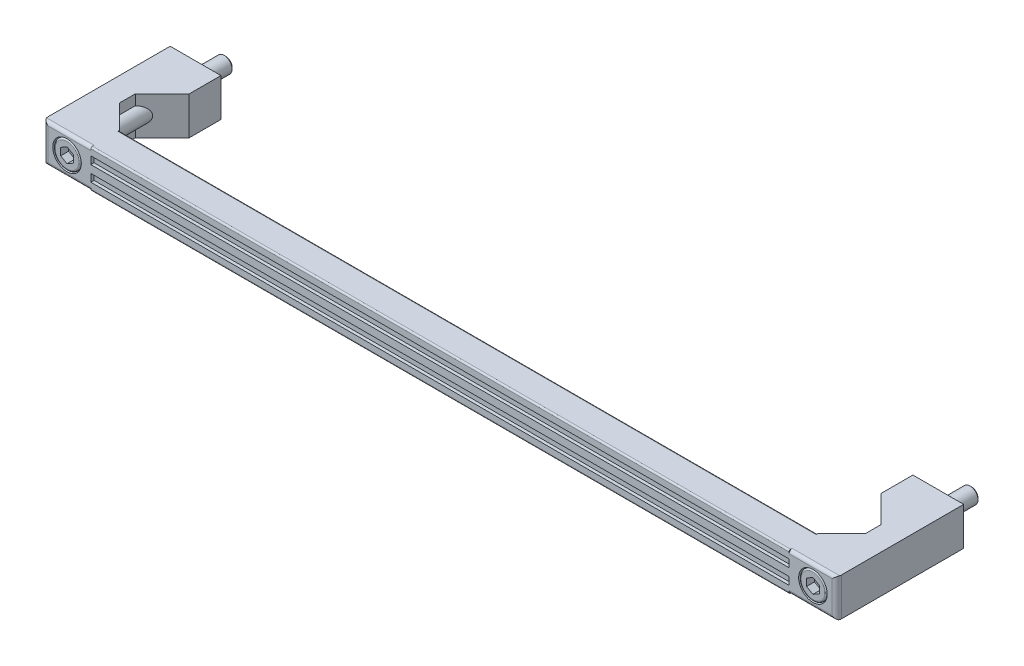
ISO-10303-21;
HEADER;
FILE_DESCRIPTION(('STEP AP214'),'2;1');
FILE_NAME('part.step','',(''),(''),'','','');
FILE_SCHEMA(('AUTOMOTIVE_DESIGN { 1 0 10303 214 1 1 1 1 }'));
ENDSEC;
DATA;
#1=APPLICATION_CONTEXT('core data for automotive mechanical design processes');
#2=APPLICATION_PROTOCOL_DEFINITION('international standard','automotive_design',2000,#1);
#3=PRODUCT_CONTEXT('',#1,'mechanical');
#4=PRODUCT('Part','Part','',(#3));
#5=PRODUCT_RELATED_PRODUCT_CATEGORY('part','',(#4));
#6=PRODUCT_DEFINITION_FORMATION('','',#4);
#7=PRODUCT_DEFINITION_CONTEXT('part definition',#1,'design');
#8=PRODUCT_DEFINITION('design','',#6,#7);
#9=PRODUCT_DEFINITION_SHAPE('','',#8);
#10=(LENGTH_UNIT() NAMED_UNIT(*) SI_UNIT(.MILLI.,.METRE.));
#11=(NAMED_UNIT(*) PLANE_ANGLE_UNIT() SI_UNIT($,.RADIAN.));
#12=(NAMED_UNIT(*) SI_UNIT($,.STERADIAN.) SOLID_ANGLE_UNIT());
#13=UNCERTAINTY_MEASURE_WITH_UNIT(LENGTH_MEASURE(1.E-05),#10,'distance_accuracy_value','');
#14=(GEOMETRIC_REPRESENTATION_CONTEXT(3) GLOBAL_UNCERTAINTY_ASSIGNED_CONTEXT((#13)) GLOBAL_UNIT_ASSIGNED_CONTEXT((#10,
#11,#12)) REPRESENTATION_CONTEXT('',''));
#15=CARTESIAN_POINT('',(0.,0.,0.));
#16=DIRECTION('',(0.,0.,1.));
#17=DIRECTION('',(1.,0.,0.));
#18=AXIS2_PLACEMENT_3D('',#15,#16,#17);
#19=CARTESIAN_POINT('',(227.37,-5.50000000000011,31.5));
#20=DIRECTION('',(-1.,0.,0.));
#21=DIRECTION('',(0.,-1.,0.));
#22=AXIS2_PLACEMENT_3D('',#19,#20,#21);
#23=CYLINDRICAL_SURFACE('',#22,0.5);
#24=DIRECTION('',(-1.,0.,0.));
#25=VECTOR('',#24,1.);
#26=CARTESIAN_POINT('',(227.37,-6.00000000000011,31.5));
#27=LINE('',#26,#25);
#28=CARTESIAN_POINT('',(227.5,-6.00000000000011,31.5));
#29=VERTEX_POINT('',#28);
#30=CARTESIAN_POINT('',(7.5,-6.00000000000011,31.5));
#31=VERTEX_POINT('',#30);
#32=EDGE_CURVE('E481',#29,#31,#27,.T.);
#33=ORIENTED_EDGE('',*,*,#32,.T.);
#34=CARTESIAN_POINT('',(7.5,-5.50000000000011,31.5));
#35=DIRECTION('',(-1.,0.,0.));
#36=DIRECTION('',(0.,0.,1.));
#37=AXIS2_PLACEMENT_3D('',#34,#35,#36);
#38=CIRCLE('',#37,0.5);
#39=CARTESIAN_POINT('',(7.5,-5.50000000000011,31.));
#40=VERTEX_POINT('',#39);
#41=EDGE_CURVE('E543',#40,#31,#38,.T.);
#42=ORIENTED_EDGE('',*,*,#41,.F.);
#43=DIRECTION('',(-1.,0.,0.));
#44=VECTOR('',#43,1.);
#45=CARTESIAN_POINT('',(227.37,-5.50000000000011,31.));
#46=LINE('',#45,#44);
#47=CARTESIAN_POINT('',(227.5,-5.50000000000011,31.));
#48=VERTEX_POINT('',#47);
#49=EDGE_CURVE('E479',#48,#40,#46,.T.);
#50=ORIENTED_EDGE('',*,*,#49,.F.);
#51=CARTESIAN_POINT('',(227.5,-5.50000000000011,31.5));
#52=DIRECTION('',(1.,0.,0.));
#53=DIRECTION('',(0.,0.,-1.));
#54=AXIS2_PLACEMENT_3D('',#51,#52,#53);
#55=CIRCLE('',#54,0.5);
#56=EDGE_CURVE('E545',#29,#48,#55,.T.);
#57=ORIENTED_EDGE('',*,*,#56,.F.);
#58=EDGE_LOOP('',(#33,#42,#50,#57));
#59=FACE_BOUND('',#58,.T.);
#60=ADVANCED_FACE('F14',(#59),#23,.T.);
#61=CARTESIAN_POINT('',(227.37,-5.50000000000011,31.));
#62=DIRECTION('',(0.,0.,1.));
#63=DIRECTION('',(0.,-1.,0.));
#64=AXIS2_PLACEMENT_3D('',#61,#62,#63);
#65=PLANE('',#64);
#66=ORIENTED_EDGE('',*,*,#49,.T.);
#67=DIRECTION('',(0.,-1.,0.));
#68=VECTOR('',#67,1.);
#69=CARTESIAN_POINT('',(7.5,5.49999999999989,31.));
#70=LINE('',#69,#68);
#71=CARTESIAN_POINT('',(7.5,5.49999999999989,31.));
#72=VERTEX_POINT('',#71);
#73=EDGE_CURVE('E371',#72,#40,#70,.T.);
#74=ORIENTED_EDGE('',*,*,#73,.F.);
#75=DIRECTION('',(-1.,0.,0.));
#76=VECTOR('',#75,1.);
#77=CARTESIAN_POINT('',(227.37,5.49999999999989,31.));
#78=LINE('',#77,#76);
#79=CARTESIAN_POINT('',(227.5,5.49999999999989,31.));
#80=VERTEX_POINT('',#79);
#81=EDGE_CURVE('E477',#80,#72,#78,.T.);
#82=ORIENTED_EDGE('',*,*,#81,.F.);
#83=DIRECTION('',(0.,1.,0.));
#84=VECTOR('',#83,1.);
#85=CARTESIAN_POINT('',(227.5,-5.50000000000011,31.));
#86=LINE('',#85,#84);
#87=EDGE_CURVE('E808',#48,#80,#86,.T.);
#88=ORIENTED_EDGE('',*,*,#87,.F.);
#89=EDGE_LOOP('',(#66,#74,#82,#88));
#90=FACE_BOUND('',#89,.T.);
#91=ADVANCED_FACE('F532',(#90),#65,.F.);
#92=CARTESIAN_POINT('',(227.37,5.49999999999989,31.5));
#93=DIRECTION('',(-1.,0.,0.));
#94=DIRECTION('',(0.,-1.,0.));
#95=AXIS2_PLACEMENT_3D('',#92,#93,#94);
#96=CYLINDRICAL_SURFACE('',#95,0.500000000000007);
#97=ORIENTED_EDGE('',*,*,#81,.T.);
#98=CARTESIAN_POINT('',(7.5,5.49999999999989,31.5));
#99=DIRECTION('',(-1.,0.,0.));
#100=DIRECTION('',(0.,0.,1.));
#101=AXIS2_PLACEMENT_3D('',#98,#99,#100);
#102=CIRCLE('',#101,0.5);
#103=CARTESIAN_POINT('',(7.5,5.99999999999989,31.5));
#104=VERTEX_POINT('',#103);
#105=EDGE_CURVE('E570',#104,#72,#102,.T.);
#106=ORIENTED_EDGE('',*,*,#105,.F.);
#107=DIRECTION('',(-1.,0.,0.));
#108=VECTOR('',#107,1.);
#109=CARTESIAN_POINT('',(227.37,5.99999999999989,31.5));
#110=LINE('',#109,#108);
#111=CARTESIAN_POINT('',(227.5,5.99999999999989,31.5));
#112=VERTEX_POINT('',#111);
#113=EDGE_CURVE('E475',#112,#104,#110,.T.);
#114=ORIENTED_EDGE('',*,*,#113,.F.);
#115=CARTESIAN_POINT('',(227.5,5.49999999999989,31.5));
#116=DIRECTION('',(1.,0.,0.));
#117=DIRECTION('',(0.,0.,-1.));
#118=AXIS2_PLACEMENT_3D('',#115,#116,#117);
#119=CIRCLE('',#118,0.5);
#120=EDGE_CURVE('E803',#80,#112,#119,.T.);
#121=ORIENTED_EDGE('',*,*,#120,.F.);
#122=EDGE_LOOP('',(#97,#106,#114,#121));
#123=FACE_BOUND('',#122,.T.);
#124=ADVANCED_FACE('F538',(#123),#96,.T.);
#125=CARTESIAN_POINT('',(227.37,5.99999999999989,31.5));
#126=DIRECTION('',(0.,-1.,0.));
#127=DIRECTION('',(1.,0.,0.));
#128=AXIS2_PLACEMENT_3D('',#125,#126,#127);
#129=PLANE('',#128);
#130=ORIENTED_EDGE('',*,*,#113,.T.);
#131=DIRECTION('',(0.,0.,1.));
#132=VECTOR('',#131,1.);
#133=CARTESIAN_POINT('',(7.5,5.99999999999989,31.));
#134=LINE('',#133,#132);
#135=CARTESIAN_POINT('',(7.5,5.99999999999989,31.));
#136=VERTEX_POINT('',#135);
#137=EDGE_CURVE('E403',#136,#104,#134,.T.);
#138=ORIENTED_EDGE('',*,*,#137,.F.);
#139=DIRECTION('',(0.707106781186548,0.,0.707106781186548));
#140=VECTOR('',#139,1.);
#141=CARTESIAN_POINT('',(0.,5.99999999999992,23.5));
#142=LINE('',#141,#140);
#143=CARTESIAN_POINT('',(0.,5.99999999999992,23.5));
#144=VERTEX_POINT('',#143);
#145=EDGE_CURVE('E431',#144,#136,#142,.T.);
#146=ORIENTED_EDGE('',*,*,#145,.F.);
#147=DIRECTION('',(0.,0.,1.));
#148=VECTOR('',#147,1.);
#149=CARTESIAN_POINT('',(0.,6.,18.5));
#150=LINE('',#149,#148);
#151=CARTESIAN_POINT('',(0.,6.,18.5));
#152=VERTEX_POINT('',#151);
#153=EDGE_CURVE('E428',#152,#144,#150,.T.);
#154=ORIENTED_EDGE('',*,*,#153,.F.);
#155=DIRECTION('',(-0.707106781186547,0.,0.707106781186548));
#156=VECTOR('',#155,1.);
#157=CARTESIAN_POINT('',(8.5,6.,10.));
#158=LINE('',#157,#156);
#159=CARTESIAN_POINT('',(8.5,6.,10.));
#160=VERTEX_POINT('',#159);
#161=EDGE_CURVE('E426',#160,#152,#158,.T.);
#162=ORIENTED_EDGE('',*,*,#161,.F.);
#163=DIRECTION('',(0.,0.,1.));
#164=VECTOR('',#163,1.);
#165=CARTESIAN_POINT('',(8.5,6.,0.));
#166=LINE('',#165,#164);
#167=CARTESIAN_POINT('',(8.5,6.,0.));
#168=VERTEX_POINT('',#167);
#169=EDGE_CURVE('E424',#168,#160,#166,.T.);
#170=ORIENTED_EDGE('',*,*,#169,.F.);
#171=DIRECTION('',(1.,0.,0.));
#172=VECTOR('',#171,1.);
#173=CARTESIAN_POINT('',(-7.5,6.,0.));
#174=LINE('',#173,#172);
#175=CARTESIAN_POINT('',(-7.5,6.,0.));
#176=VERTEX_POINT('',#175);
#177=EDGE_CURVE('E422',#176,#168,#174,.T.);
#178=ORIENTED_EDGE('',*,*,#177,.F.);
#179=DIRECTION('',(0.,0.,-1.));
#180=VECTOR('',#179,1.);
#181=CARTESIAN_POINT('',(-7.5,5.99999999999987,38.5));
#182=LINE('',#181,#180);
#183=CARTESIAN_POINT('',(-7.5,5.99999999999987,38.5));
#184=VERTEX_POINT('',#183);
#185=EDGE_CURVE('E420',#184,#176,#182,.T.);
#186=ORIENTED_EDGE('',*,*,#185,.F.);
#187=CARTESIAN_POINT('',(-6.,5.99999999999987,38.5));
#188=DIRECTION('',(0.,-1.,0.));
#189=DIRECTION('',(1.,0.,0.));
#190=AXIS2_PLACEMENT_3D('',#187,#188,#189);
#191=CIRCLE('',#190,1.5);
#192=CARTESIAN_POINT('',(-7.4142135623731,5.99999999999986,39.));
#193=VERTEX_POINT('',#192);
#194=EDGE_CURVE('E399',#193,#184,#191,.T.);
#195=ORIENTED_EDGE('',*,*,#194,.F.);
#196=DIRECTION('',(1.,0.,0.));
#197=VECTOR('',#196,1.);
#198=CARTESIAN_POINT('',(-12.5,5.99999999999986,39.));
#199=LINE('',#198,#197);
#200=CARTESIAN_POINT('',(7.5,5.99999999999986,39.));
#201=VERTEX_POINT('',#200);
#202=EDGE_CURVE('E501',#193,#201,#199,.T.);
#203=ORIENTED_EDGE('',*,*,#202,.T.);
#204=DIRECTION('',(0.,0.,-1.));
#205=VECTOR('',#204,1.);
#206=CARTESIAN_POINT('',(7.5,5.99999999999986,39.5));
#207=LINE('',#206,#205);
#208=CARTESIAN_POINT('',(7.5,5.99999999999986,39.5));
#209=VERTEX_POINT('',#208);
#210=EDGE_CURVE('E716',#209,#201,#207,.T.);
#211=ORIENTED_EDGE('',*,*,#210,.F.);
#212=DIRECTION('',(-1.,0.,0.));
#213=VECTOR('',#212,1.);
#214=CARTESIAN_POINT('',(227.5,5.99999999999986,39.5));
#215=LINE('',#214,#213);
#216=CARTESIAN_POINT('',(227.5,5.99999999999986,39.5));
#217=VERTEX_POINT('',#216);
#218=EDGE_CURVE('E798',#217,#209,#215,.T.);
#219=ORIENTED_EDGE('',*,*,#218,.F.);
#220=DIRECTION('',(0.,0.,1.));
#221=VECTOR('',#220,1.);
#222=CARTESIAN_POINT('',(227.5,5.99999999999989,31.5));
#223=LINE('',#222,#221);
#224=CARTESIAN_POINT('',(227.5,5.99999999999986,39.));
#225=VERTEX_POINT('',#224);
#226=EDGE_CURVE('E797',#225,#217,#223,.T.);
#227=ORIENTED_EDGE('',*,*,#226,.F.);
#228=DIRECTION('',(-1.,0.,0.));
#229=VECTOR('',#228,1.);
#230=CARTESIAN_POINT('',(247.5,5.99999999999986,39.));
#231=LINE('',#230,#229);
#232=CARTESIAN_POINT('',(242.414213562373,5.99999999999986,39.));
#233=VERTEX_POINT('',#232);
#234=EDGE_CURVE('E496',#225,#233,#231,.F.);
#235=ORIENTED_EDGE('',*,*,#234,.T.);
#236=CARTESIAN_POINT('',(241.,5.99999999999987,38.5));
#237=DIRECTION('',(0.,-1.,0.));
#238=DIRECTION('',(1.,0.,0.));
#239=AXIS2_PLACEMENT_3D('',#236,#237,#238);
#240=CIRCLE('',#239,1.49999999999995);
#241=CARTESIAN_POINT('',(242.5,5.99999999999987,38.5));
#242=VERTEX_POINT('',#241);
#243=EDGE_CURVE('E792',#242,#233,#240,.T.);
#244=ORIENTED_EDGE('',*,*,#243,.F.);
#245=DIRECTION('',(0.,0.,1.));
#246=VECTOR('',#245,1.);
#247=CARTESIAN_POINT('',(242.5,6.,0.));
#248=LINE('',#247,#246);
#249=CARTESIAN_POINT('',(242.5,6.,0.));
#250=VERTEX_POINT('',#249);
#251=EDGE_CURVE('E842',#250,#242,#248,.T.);
#252=ORIENTED_EDGE('',*,*,#251,.F.);
#253=DIRECTION('',(1.,0.,0.));
#254=VECTOR('',#253,1.);
#255=CARTESIAN_POINT('',(226.5,6.,0.));
#256=LINE('',#255,#254);
#257=CARTESIAN_POINT('',(226.5,6.,0.));
#258=VERTEX_POINT('',#257);
#259=EDGE_CURVE('E840',#258,#250,#256,.T.);
#260=ORIENTED_EDGE('',*,*,#259,.F.);
#261=DIRECTION('',(0.,0.,-1.));
#262=VECTOR('',#261,1.);
#263=CARTESIAN_POINT('',(226.5,6.,10.));
#264=LINE('',#263,#262);
#265=CARTESIAN_POINT('',(226.5,6.,10.));
#266=VERTEX_POINT('',#265);
#267=EDGE_CURVE('E837',#266,#258,#264,.T.);
#268=ORIENTED_EDGE('',*,*,#267,.F.);
#269=DIRECTION('',(-0.707106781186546,0.,-0.707106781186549));
#270=VECTOR('',#269,1.);
#271=CARTESIAN_POINT('',(235.,6.,18.5));
#272=LINE('',#271,#270);
#273=CARTESIAN_POINT('',(235.,6.,18.5));
#274=VERTEX_POINT('',#273);
#275=EDGE_CURVE('E835',#274,#266,#272,.T.);
#276=ORIENTED_EDGE('',*,*,#275,.F.);
#277=DIRECTION('',(0.,0.,-1.));
#278=VECTOR('',#277,1.);
#279=CARTESIAN_POINT('',(235.,5.99999999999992,23.5));
#280=LINE('',#279,#278);
#281=CARTESIAN_POINT('',(235.,5.99999999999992,23.5));
#282=VERTEX_POINT('',#281);
#283=EDGE_CURVE('E851',#282,#274,#280,.T.);
#284=ORIENTED_EDGE('',*,*,#283,.F.);
#285=DIRECTION('',(0.707106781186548,0.,-0.707106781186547));
#286=VECTOR('',#285,1.);
#287=CARTESIAN_POINT('',(227.5,5.99999999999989,31.));
#288=LINE('',#287,#286);
#289=CARTESIAN_POINT('',(227.5,5.99999999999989,31.));
#290=VERTEX_POINT('',#289);
#291=EDGE_CURVE('E848',#290,#282,#288,.T.);
#292=ORIENTED_EDGE('',*,*,#291,.F.);
#293=DIRECTION('',(0.,0.,-1.));
#294=VECTOR('',#293,1.);
#295=CARTESIAN_POINT('',(227.5,5.99999999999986,40.));
#296=LINE('',#295,#294);
#297=EDGE_CURVE('E845',#112,#290,#296,.T.);
#298=ORIENTED_EDGE('',*,*,#297,.F.);
#299=EDGE_LOOP('',(#130,#138,#146,#154,#162,#170,#178,#186,#195,#203,#211,#219,#227,#235,#244,
#252,#260,#268,#276,#284,#292,#298));
#300=FACE_BOUND('',#299,.T.);
#301=ADVANCED_FACE('F700',(#300),#129,.F.);
#302=CARTESIAN_POINT('',(227.37,3.59999999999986,40.));
#303=DIRECTION('',(0.,1.,0.));
#304=DIRECTION('',(-1.,0.,0.));
#305=AXIS2_PLACEMENT_3D('',#302,#303,#304);
#306=PLANE('',#305);
#307=DIRECTION('',(-1.,0.,0.));
#308=VECTOR('',#307,1.);
#309=CARTESIAN_POINT('',(227.37,3.59999999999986,40.));
#310=LINE('',#309,#308);
#311=CARTESIAN_POINT('',(227.5,3.59999999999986,40.));
#312=VERTEX_POINT('',#311);
#313=CARTESIAN_POINT('',(7.5,3.59999999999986,40.));
#314=VERTEX_POINT('',#313);
#315=EDGE_CURVE('E473',#312,#314,#310,.T.);
#316=ORIENTED_EDGE('',*,*,#315,.T.);
#317=DIRECTION('',(0.,0.,1.));
#318=VECTOR('',#317,1.);
#319=CARTESIAN_POINT('',(7.5,3.59999999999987,39.));
#320=LINE('',#319,#318);
#321=CARTESIAN_POINT('',(7.5,3.59999999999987,39.));
#322=VERTEX_POINT('',#321);
#323=EDGE_CURVE('E732',#322,#314,#320,.T.);
#324=ORIENTED_EDGE('',*,*,#323,.F.);
#325=DIRECTION('',(-1.,0.,0.));
#326=VECTOR('',#325,1.);
#327=CARTESIAN_POINT('',(227.37,3.59999999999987,39.));
#328=LINE('',#327,#326);
#329=CARTESIAN_POINT('',(227.5,3.59999999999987,39.));
#330=VERTEX_POINT('',#329);
#331=EDGE_CURVE('E471',#330,#322,#328,.T.);
#332=ORIENTED_EDGE('',*,*,#331,.F.);
#333=DIRECTION('',(0.,0.,-1.));
#334=VECTOR('',#333,1.);
#335=CARTESIAN_POINT('',(227.5,3.59999999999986,40.));
#336=LINE('',#335,#334);
#337=EDGE_CURVE('E1585',#312,#330,#336,.T.);
#338=ORIENTED_EDGE('',*,*,#337,.F.);
#339=EDGE_LOOP('',(#316,#324,#332,#338));
#340=FACE_BOUND('',#339,.T.);
#341=ADVANCED_FACE('F1011',(#340),#306,.F.);
#342=CARTESIAN_POINT('',(227.37,3.59999999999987,39.));
#343=DIRECTION('',(0.,0.,-1.));
#344=DIRECTION('',(0.,1.,0.));
#345=AXIS2_PLACEMENT_3D('',#342,#343,#344);
#346=PLANE('',#345);
#347=ORIENTED_EDGE('',*,*,#331,.T.);
#348=DIRECTION('',(0.,1.,0.));
#349=VECTOR('',#348,1.);
#350=CARTESIAN_POINT('',(7.5,1.19999999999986,39.));
#351=LINE('',#350,#349);
#352=CARTESIAN_POINT('',(7.5,1.19999999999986,39.));
#353=VERTEX_POINT('',#352);
#354=EDGE_CURVE('E735',#353,#322,#351,.T.);
#355=ORIENTED_EDGE('',*,*,#354,.F.);
#356=DIRECTION('',(-1.,0.,0.));
#357=VECTOR('',#356,1.);
#358=CARTESIAN_POINT('',(227.37,1.19999999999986,39.));
#359=LINE('',#358,#357);
#360=CARTESIAN_POINT('',(227.5,1.19999999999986,39.));
#361=VERTEX_POINT('',#360);
#362=EDGE_CURVE('E469',#361,#353,#359,.T.);
#363=ORIENTED_EDGE('',*,*,#362,.F.);
#364=DIRECTION('',(0.,-1.,0.));
#365=VECTOR('',#364,1.);
#366=CARTESIAN_POINT('',(227.5,3.59999999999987,39.));
#367=LINE('',#366,#365);
#368=EDGE_CURVE('E1588',#330,#361,#367,.T.);
#369=ORIENTED_EDGE('',*,*,#368,.F.);
#370=EDGE_LOOP('',(#347,#355,#363,#369));
#371=FACE_BOUND('',#370,.T.);
#372=ADVANCED_FACE('F1007',(#371),#346,.F.);
#373=CARTESIAN_POINT('',(227.37,1.19999999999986,39.));
#374=DIRECTION('',(0.,-1.,0.));
#375=DIRECTION('',(0.,0.,-1.));
#376=AXIS2_PLACEMENT_3D('',#373,#374,#375);
#377=PLANE('',#376);
#378=ORIENTED_EDGE('',*,*,#362,.T.);
#379=DIRECTION('',(0.,0.,-1.));
#380=VECTOR('',#379,1.);
#381=CARTESIAN_POINT('',(7.5,1.19999999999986,40.));
#382=LINE('',#381,#380);
#383=CARTESIAN_POINT('',(7.5,1.19999999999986,40.));
#384=VERTEX_POINT('',#383);
#385=EDGE_CURVE('E738',#384,#353,#382,.T.);
#386=ORIENTED_EDGE('',*,*,#385,.F.);
#387=DIRECTION('',(-1.,0.,0.));
#388=VECTOR('',#387,1.);
#389=CARTESIAN_POINT('',(227.37,1.19999999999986,40.));
#390=LINE('',#389,#388);
#391=CARTESIAN_POINT('',(227.5,1.19999999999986,40.));
#392=VERTEX_POINT('',#391);
#393=EDGE_CURVE('E467',#392,#384,#390,.T.);
#394=ORIENTED_EDGE('',*,*,#393,.F.);
#395=DIRECTION('',(0.,0.,1.));
#396=VECTOR('',#395,1.);
#397=CARTESIAN_POINT('',(227.5,1.19999999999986,39.));
#398=LINE('',#397,#396);
#399=EDGE_CURVE('E1591',#361,#392,#398,.T.);
#400=ORIENTED_EDGE('',*,*,#399,.F.);
#401=EDGE_LOOP('',(#378,#386,#394,#400));
#402=FACE_BOUND('',#401,.T.);
#403=ADVANCED_FACE('F1003',(#402),#377,.F.);
#404=CARTESIAN_POINT('',(227.37,-1.20000000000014,40.));
#405=DIRECTION('',(0.,1.,0.));
#406=DIRECTION('',(0.,0.,1.));
#407=AXIS2_PLACEMENT_3D('',#404,#405,#406);
#408=PLANE('',#407);
#409=DIRECTION('',(-1.,0.,0.));
#410=VECTOR('',#409,1.);
#411=CARTESIAN_POINT('',(227.37,-1.20000000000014,40.));
#412=LINE('',#411,#410);
#413=CARTESIAN_POINT('',(227.5,-1.20000000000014,40.));
#414=VERTEX_POINT('',#413);
#415=CARTESIAN_POINT('',(7.5,-1.20000000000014,40.));
#416=VERTEX_POINT('',#415);
#417=EDGE_CURVE('E375',#414,#416,#412,.T.);
#418=ORIENTED_EDGE('',*,*,#417,.T.);
#419=DIRECTION('',(0.,0.,1.));
#420=VECTOR('',#419,1.);
#421=CARTESIAN_POINT('',(7.5,-1.20000000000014,39.));
#422=LINE('',#421,#420);
#423=CARTESIAN_POINT('',(7.5,-1.20000000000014,39.));
#424=VERTEX_POINT('',#423);
#425=EDGE_CURVE('E741',#424,#416,#422,.T.);
#426=ORIENTED_EDGE('',*,*,#425,.F.);
#427=DIRECTION('',(-1.,0.,0.));
#428=VECTOR('',#427,1.);
#429=CARTESIAN_POINT('',(227.37,-1.20000000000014,39.));
#430=LINE('',#429,#428);
#431=CARTESIAN_POINT('',(227.5,-1.20000000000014,39.));
#432=VERTEX_POINT('',#431);
#433=EDGE_CURVE('E36',#432,#424,#430,.T.);
#434=ORIENTED_EDGE('',*,*,#433,.F.);
#435=DIRECTION('',(0.,0.,-1.));
#436=VECTOR('',#435,1.);
#437=CARTESIAN_POINT('',(227.5,-1.20000000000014,40.));
#438=LINE('',#437,#436);
#439=EDGE_CURVE('E1595',#414,#432,#438,.T.);
#440=ORIENTED_EDGE('',*,*,#439,.F.);
#441=EDGE_LOOP('',(#418,#426,#434,#440));
#442=FACE_BOUND('',#441,.T.);
#443=ADVANCED_FACE('F1000',(#442),#408,.F.);
#444=CARTESIAN_POINT('',(227.37,-1.20000000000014,39.));
#445=DIRECTION('',(0.,0.,-1.));
#446=DIRECTION('',(0.,1.,0.));
#447=AXIS2_PLACEMENT_3D('',#444,#445,#446);
#448=PLANE('',#447);
#449=ORIENTED_EDGE('',*,*,#433,.T.);
#450=DIRECTION('',(0.,1.,0.));
#451=VECTOR('',#450,1.);
#452=CARTESIAN_POINT('',(7.5,-3.60000000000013,39.));
#453=LINE('',#452,#451);
#454=CARTESIAN_POINT('',(7.5,-3.60000000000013,39.));
#455=VERTEX_POINT('',#454);
#456=EDGE_CURVE('E744',#455,#424,#453,.T.);
#457=ORIENTED_EDGE('',*,*,#456,.F.);
#458=DIRECTION('',(-1.,0.,0.));
#459=VECTOR('',#458,1.);
#460=CARTESIAN_POINT('',(227.37,-3.60000000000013,39.));
#461=LINE('',#460,#459);
#462=CARTESIAN_POINT('',(227.5,-3.60000000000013,39.));
#463=VERTEX_POINT('',#462);
#464=EDGE_CURVE('E28',#463,#455,#461,.T.);
#465=ORIENTED_EDGE('',*,*,#464,.F.);
#466=DIRECTION('',(0.,-1.,0.));
#467=VECTOR('',#466,1.);
#468=CARTESIAN_POINT('',(227.5,-1.20000000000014,39.));
#469=LINE('',#468,#467);
#470=EDGE_CURVE('E370',#432,#463,#469,.T.);
#471=ORIENTED_EDGE('',*,*,#470,.F.);
#472=EDGE_LOOP('',(#449,#457,#465,#471));
#473=FACE_BOUND('',#472,.T.);
#474=ADVANCED_FACE('F995',(#473),#448,.F.);
#475=CARTESIAN_POINT('',(227.37,-3.60000000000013,39.));
#476=DIRECTION('',(0.,-1.,0.));
#477=DIRECTION('',(0.,0.,-1.));
#478=AXIS2_PLACEMENT_3D('',#475,#476,#477);
#479=PLANE('',#478);
#480=ORIENTED_EDGE('',*,*,#464,.T.);
#481=DIRECTION('',(0.,0.,-1.));
#482=VECTOR('',#481,1.);
#483=CARTESIAN_POINT('',(7.5,-3.60000000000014,40.));
#484=LINE('',#483,#482);
#485=CARTESIAN_POINT('',(7.5,-3.60000000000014,40.));
#486=VERTEX_POINT('',#485);
#487=EDGE_CURVE('E358',#486,#455,#484,.T.);
#488=ORIENTED_EDGE('',*,*,#487,.F.);
#489=DIRECTION('',(-1.,0.,0.));
#490=VECTOR('',#489,1.);
#491=CARTESIAN_POINT('',(227.37,-3.60000000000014,40.));
#492=LINE('',#491,#490);
#493=CARTESIAN_POINT('',(227.5,-3.60000000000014,40.));
#494=VERTEX_POINT('',#493);
#495=EDGE_CURVE('E353',#494,#486,#492,.T.);
#496=ORIENTED_EDGE('',*,*,#495,.F.);
#497=DIRECTION('',(0.,0.,1.));
#498=VECTOR('',#497,1.);
#499=CARTESIAN_POINT('',(227.5,-3.60000000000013,39.));
#500=LINE('',#499,#498);
#501=EDGE_CURVE('E356',#463,#494,#500,.T.);
#502=ORIENTED_EDGE('',*,*,#501,.F.);
#503=EDGE_LOOP('',(#480,#488,#496,#502));
#504=FACE_BOUND('',#503,.T.);
#505=ADVANCED_FACE('F355',(#504),#479,.F.);
#506=CARTESIAN_POINT('',(227.37,-3.60000000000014,40.));
#507=DIRECTION('',(0.,0.,-1.));
#508=DIRECTION('',(0.,1.,0.));
#509=AXIS2_PLACEMENT_3D('',#506,#507,#508);
#510=PLANE('',#509);
#511=ORIENTED_EDGE('',*,*,#315,.F.);
#512=DIRECTION('',(0.,1.,0.));
#513=VECTOR('',#512,1.);
#514=CARTESIAN_POINT('',(227.5,-6.00000000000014,40.));
#515=LINE('',#514,#513);
#516=EDGE_CURVE('E378',#392,#312,#515,.T.);
#517=ORIENTED_EDGE('',*,*,#516,.F.);
#518=ORIENTED_EDGE('',*,*,#393,.T.);
#519=DIRECTION('',(0.,1.,0.));
#520=VECTOR('',#519,1.);
#521=CARTESIAN_POINT('',(7.5,-6.00000000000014,40.));
#522=LINE('',#521,#520);
#523=EDGE_CURVE('E438',#384,#314,#522,.T.);
#524=ORIENTED_EDGE('',*,*,#523,.T.);
#525=EDGE_LOOP('',(#511,#517,#518,#524));
#526=FACE_BOUND('',#525,.T.);
#527=ORIENTED_EDGE('',*,*,#417,.F.);
#528=EDGE_CURVE('E369',#494,#414,#515,.T.);
#529=ORIENTED_EDGE('',*,*,#528,.F.);
#530=ORIENTED_EDGE('',*,*,#495,.T.);
#531=EDGE_CURVE('E441',#486,#416,#522,.T.);
#532=ORIENTED_EDGE('',*,*,#531,.T.);
#533=EDGE_LOOP('',(#527,#529,#530,#532));
#534=FACE_BOUND('',#533,.T.);
#535=DIRECTION('',(0.,-1.,0.));
#536=VECTOR('',#535,1.);
#537=CARTESIAN_POINT('',(227.5,5.49999999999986,40.));
#538=LINE('',#537,#536);
#539=CARTESIAN_POINT('',(227.5,5.49999999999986,40.));
#540=VERTEX_POINT('',#539);
#541=CARTESIAN_POINT('',(227.5,4.99999999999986,40.));
#542=VERTEX_POINT('',#541);
#543=EDGE_CURVE('E805',#540,#542,#538,.T.);
#544=ORIENTED_EDGE('',*,*,#543,.F.);
#545=DIRECTION('',(-1.,0.,0.));
#546=VECTOR('',#545,1.);
#547=CARTESIAN_POINT('',(227.5,5.49999999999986,40.));
#548=LINE('',#547,#546);
#549=CARTESIAN_POINT('',(7.5,5.49999999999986,40.));
#550=VERTEX_POINT('',#549);
#551=EDGE_CURVE('E768',#540,#550,#548,.T.);
#552=ORIENTED_EDGE('',*,*,#551,.T.);
#553=DIRECTION('',(0.,1.,0.));
#554=VECTOR('',#553,1.);
#555=CARTESIAN_POINT('',(7.5,3.59999999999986,40.));
#556=LINE('',#555,#554);
#557=CARTESIAN_POINT('',(7.5,4.99999999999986,40.));
#558=VERTEX_POINT('',#557);
#559=EDGE_CURVE('E727',#558,#550,#556,.T.);
#560=ORIENTED_EDGE('',*,*,#559,.F.);
#561=DIRECTION('',(1.,0.,0.));
#562=VECTOR('',#561,1.);
#563=CARTESIAN_POINT('',(-12.5,4.99999999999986,40.));
#564=LINE('',#563,#562);
#565=CARTESIAN_POINT('',(-6.,4.99999999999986,40.));
#566=VERTEX_POINT('',#565);
#567=EDGE_CURVE('E573',#566,#558,#564,.T.);
#568=ORIENTED_EDGE('',*,*,#567,.F.);
#569=DIRECTION('',(0.,1.,0.));
#570=VECTOR('',#569,1.);
#571=CARTESIAN_POINT('',(-6.,-6.00000000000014,40.));
#572=LINE('',#571,#570);
#573=CARTESIAN_POINT('',(-6.,-5.00000000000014,40.));
#574=VERTEX_POINT('',#573);
#575=EDGE_CURVE('E418',#574,#566,#572,.T.);
#576=ORIENTED_EDGE('',*,*,#575,.F.);
#577=DIRECTION('',(1.,0.,0.));
#578=VECTOR('',#577,1.);
#579=CARTESIAN_POINT('',(-12.5,-5.00000000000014,40.));
#580=LINE('',#579,#578);
#581=CARTESIAN_POINT('',(7.5,-5.00000000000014,40.));
#582=VERTEX_POINT('',#581);
#583=EDGE_CURVE('E575',#574,#582,#580,.T.);
#584=ORIENTED_EDGE('',*,*,#583,.T.);
#585=DIRECTION('',(0.,1.,0.));
#586=VECTOR('',#585,1.);
#587=CARTESIAN_POINT('',(7.5,-5.50000000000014,40.));
#588=LINE('',#587,#586);
#589=CARTESIAN_POINT('',(7.5,-5.50000000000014,40.));
#590=VERTEX_POINT('',#589);
#591=EDGE_CURVE('E747',#590,#582,#588,.T.);
#592=ORIENTED_EDGE('',*,*,#591,.F.);
#593=DIRECTION('',(-1.,0.,0.));
#594=VECTOR('',#593,1.);
#595=CARTESIAN_POINT('',(227.5,-5.50000000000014,40.));
#596=LINE('',#595,#594);
#597=CARTESIAN_POINT('',(227.5,-5.50000000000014,40.));
#598=VERTEX_POINT('',#597);
#599=EDGE_CURVE('E762',#598,#590,#596,.T.);
#600=ORIENTED_EDGE('',*,*,#599,.F.);
#601=DIRECTION('',(0.,-1.,0.));
#602=VECTOR('',#601,1.);
#603=CARTESIAN_POINT('',(227.5,-3.60000000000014,40.));
#604=LINE('',#603,#602);
#605=CARTESIAN_POINT('',(227.5,-5.00000000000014,40.));
#606=VERTEX_POINT('',#605);
#607=EDGE_CURVE('E787',#606,#598,#604,.T.);
#608=ORIENTED_EDGE('',*,*,#607,.F.);
#609=DIRECTION('',(-1.,0.,0.));
#610=VECTOR('',#609,1.);
#611=CARTESIAN_POINT('',(247.5,-5.00000000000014,40.));
#612=LINE('',#611,#610);
#613=CARTESIAN_POINT('',(241.,-5.00000000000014,40.));
#614=VERTEX_POINT('',#613);
#615=EDGE_CURVE('E628',#614,#606,#612,.T.);
#616=ORIENTED_EDGE('',*,*,#615,.F.);
#617=DIRECTION('',(0.,1.,0.));
#618=VECTOR('',#617,1.);
#619=CARTESIAN_POINT('',(241.,-6.00000000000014,40.));
#620=LINE('',#619,#618);
#621=CARTESIAN_POINT('',(241.,4.99999999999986,40.));
#622=VERTEX_POINT('',#621);
#623=EDGE_CURVE('E377',#614,#622,#620,.T.);
#624=ORIENTED_EDGE('',*,*,#623,.T.);
#625=DIRECTION('',(-1.,0.,0.));
#626=VECTOR('',#625,1.);
#627=CARTESIAN_POINT('',(247.5,4.99999999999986,40.));
#628=LINE('',#627,#626);
#629=EDGE_CURVE('E781',#622,#542,#628,.T.);
#630=ORIENTED_EDGE('',*,*,#629,.T.);
#631=EDGE_LOOP('',(#544,#552,#560,#568,#576,#584,#592,#600,#608,#616,#624,#630));
#632=FACE_BOUND('',#631,.T.);
#633=CARTESIAN_POINT('',(0.,-1.39659253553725E-13,40.));
#634=DIRECTION('',(0.,0.,-1.));
#635=DIRECTION('',(0.,1.,0.));
#636=AXIS2_PLACEMENT_3D('',#633,#634,#635);
#637=CIRCLE('',#636,4.5);
#638=CARTESIAN_POINT('',(0.,4.49999999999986,40.));
#639=VERTEX_POINT('',#638);
#640=EDGE_CURVE('E895',#639,#639,#637,.T.);
#641=ORIENTED_EDGE('',*,*,#640,.T.);
#642=EDGE_LOOP('',(#641));
#643=FACE_BOUND('',#642,.T.);
#644=CARTESIAN_POINT('',(235.,-1.39659253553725E-13,40.));
#645=DIRECTION('',(0.,0.,-1.));
#646=DIRECTION('',(0.,1.,0.));
#647=AXIS2_PLACEMENT_3D('',#644,#645,#646);
#648=CIRCLE('',#647,4.5);
#649=CARTESIAN_POINT('',(235.,4.49999999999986,40.));
#650=VERTEX_POINT('',#649);
#651=EDGE_CURVE('E884',#650,#650,#648,.T.);
#652=ORIENTED_EDGE('',*,*,#651,.T.);
#653=EDGE_LOOP('',(#652));
#654=FACE_BOUND('',#653,.T.);
#655=ADVANCED_FACE('F373',(#526,#534,#632,#643,#654),#510,.F.);
#656=CARTESIAN_POINT('',(227.5,5.49999999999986,39.5));
#657=DIRECTION('',(-1.,0.,0.));
#658=DIRECTION('',(0.,-1.,0.));
#659=AXIS2_PLACEMENT_3D('',#656,#657,#658);
#660=CYLINDRICAL_SURFACE('',#659,0.5);
#661=ORIENTED_EDGE('',*,*,#551,.F.);
#662=CARTESIAN_POINT('',(227.5,5.49999999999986,39.5));
#663=DIRECTION('',(1.,0.,0.));
#664=DIRECTION('',(0.,0.,-1.));
#665=AXIS2_PLACEMENT_3D('',#662,#663,#664);
#666=CIRCLE('',#665,0.5);
#667=EDGE_CURVE('E802',#217,#540,#666,.T.);
#668=ORIENTED_EDGE('',*,*,#667,.F.);
#669=ORIENTED_EDGE('',*,*,#218,.T.);
#670=CARTESIAN_POINT('',(7.5,5.49999999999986,39.5));
#671=DIRECTION('',(-1.,0.,0.));
#672=DIRECTION('',(0.,0.,1.));
#673=AXIS2_PLACEMENT_3D('',#670,#671,#672);
#674=CIRCLE('',#673,0.5);
#675=EDGE_CURVE('E723',#550,#209,#674,.T.);
#676=ORIENTED_EDGE('',*,*,#675,.F.);
#677=EDGE_LOOP('',(#661,#668,#669,#676));
#678=FACE_BOUND('',#677,.T.);
#679=ADVANCED_FACE('F987',(#678),#660,.T.);
#680=CARTESIAN_POINT('',(227.5,-5.50000000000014,39.5));
#681=DIRECTION('',(-1.,0.,0.));
#682=DIRECTION('',(0.,-1.,0.));
#683=AXIS2_PLACEMENT_3D('',#680,#681,#682);
#684=CYLINDRICAL_SURFACE('',#683,0.499999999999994);
#685=DIRECTION('',(-1.,0.,0.));
#686=VECTOR('',#685,1.);
#687=CARTESIAN_POINT('',(227.5,-6.00000000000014,39.5));
#688=LINE('',#687,#686);
#689=CARTESIAN_POINT('',(227.5,-6.00000000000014,39.5));
#690=VERTEX_POINT('',#689);
#691=CARTESIAN_POINT('',(7.5,-6.00000000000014,39.5));
#692=VERTEX_POINT('',#691);
#693=EDGE_CURVE('E760',#690,#692,#688,.T.);
#694=ORIENTED_EDGE('',*,*,#693,.F.);
#695=CARTESIAN_POINT('',(227.5,-5.50000000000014,39.5));
#696=DIRECTION('',(1.,0.,0.));
#697=DIRECTION('',(0.,0.,-1.));
#698=AXIS2_PLACEMENT_3D('',#695,#696,#697);
#699=CIRCLE('',#698,0.5);
#700=EDGE_CURVE('E765',#598,#690,#699,.T.);
#701=ORIENTED_EDGE('',*,*,#700,.F.);
#702=ORIENTED_EDGE('',*,*,#599,.T.);
#703=CARTESIAN_POINT('',(7.5,-5.50000000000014,39.5));
#704=DIRECTION('',(-1.,0.,0.));
#705=DIRECTION('',(0.,0.,1.));
#706=AXIS2_PLACEMENT_3D('',#703,#704,#705);
#707=CIRCLE('',#706,0.5);
#708=EDGE_CURVE('E750',#692,#590,#707,.T.);
#709=ORIENTED_EDGE('',*,*,#708,.F.);
#710=EDGE_LOOP('',(#694,#701,#702,#709));
#711=FACE_BOUND('',#710,.T.);
#712=ADVANCED_FACE('F758',(#711),#684,.T.);
#713=CARTESIAN_POINT('',(7.5,-6.00000000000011,31.));
#714=DIRECTION('',(-1.,0.,0.));
#715=DIRECTION('',(0.,-1.,0.));
#716=AXIS2_PLACEMENT_3D('',#713,#714,#715);
#717=PLANE('',#716);
#718=ORIENTED_EDGE('',*,*,#210,.T.);
#719=CARTESIAN_POINT('',(7.5,4.99999999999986,39.));
#720=DIRECTION('',(1.,0.,0.));
#721=DIRECTION('',(0.,1.,0.));
#722=AXIS2_PLACEMENT_3D('',#719,#720,#721);
#723=CIRCLE('',#722,1.);
#724=EDGE_CURVE('E569',#201,#558,#723,.T.);
#725=ORIENTED_EDGE('',*,*,#724,.T.);
#726=ORIENTED_EDGE('',*,*,#559,.T.);
#727=ORIENTED_EDGE('',*,*,#675,.T.);
#728=EDGE_LOOP('',(#718,#725,#726,#727));
#729=FACE_BOUND('',#728,.T.);
#730=ADVANCED_FACE('F719',(#729),#717,.T.);
#731=ORIENTED_EDGE('',*,*,#591,.T.);
#732=CARTESIAN_POINT('',(7.5,-5.00000000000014,39.));
#733=DIRECTION('',(1.,0.,0.));
#734=DIRECTION('',(0.,1.,0.));
#735=AXIS2_PLACEMENT_3D('',#732,#733,#734);
#736=CIRCLE('',#735,1.);
#737=CARTESIAN_POINT('',(7.5,-6.00000000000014,39.));
#738=VERTEX_POINT('',#737);
#739=EDGE_CURVE('E566',#582,#738,#736,.T.);
#740=ORIENTED_EDGE('',*,*,#739,.T.);
#741=DIRECTION('',(0.,0.,1.));
#742=VECTOR('',#741,1.);
#743=CARTESIAN_POINT('',(7.5,-6.00000000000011,31.5));
#744=LINE('',#743,#742);
#745=EDGE_CURVE('E552',#738,#692,#744,.T.);
#746=ORIENTED_EDGE('',*,*,#745,.T.);
#747=ORIENTED_EDGE('',*,*,#708,.T.);
#748=EDGE_LOOP('',(#731,#740,#746,#747));
#749=FACE_BOUND('',#748,.T.);
#750=ADVANCED_FACE('F756',(#749),#717,.T.);
#751=CARTESIAN_POINT('',(0.,-1.30930550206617E-13,37.5));
#752=DIRECTION('',(0.,0.,1.));
#753=DIRECTION('',(0.,-1.,0.));
#754=AXIS2_PLACEMENT_3D('',#751,#752,#753);
#755=PLANE('',#754);
#756=DIRECTION('',(0.,-1.,0.));
#757=VECTOR('',#756,1.);
#758=CARTESIAN_POINT('',(-2.,1.15470053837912,37.5));
#759=LINE('',#758,#757);
#760=CARTESIAN_POINT('',(-2.,1.15470053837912,37.5));
#761=VERTEX_POINT('',#760);
#762=CARTESIAN_POINT('',(-2.,-1.15470053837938,37.5));
#763=VERTEX_POINT('',#762);
#764=EDGE_CURVE('E1654',#761,#763,#759,.T.);
#765=ORIENTED_EDGE('',*,*,#764,.T.);
#766=DIRECTION('',(0.866025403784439,-0.5,0.));
#767=VECTOR('',#766,1.);
#768=CARTESIAN_POINT('',(-2.,-1.15470053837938,37.5));
#769=LINE('',#768,#767);
#770=CARTESIAN_POINT('',(0.,-2.30940107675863,37.5));
#771=VERTEX_POINT('',#770);
#772=EDGE_CURVE('E1657',#763,#771,#769,.T.);
#773=ORIENTED_EDGE('',*,*,#772,.T.);
#774=DIRECTION('',(0.866025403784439,0.5,0.));
#775=VECTOR('',#774,1.);
#776=CARTESIAN_POINT('',(0.,-2.30940107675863,37.5));
#777=LINE('',#776,#775);
#778=CARTESIAN_POINT('',(2.,-1.15470053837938,37.5));
#779=VERTEX_POINT('',#778);
#780=EDGE_CURVE('E1661',#771,#779,#777,.T.);
#781=ORIENTED_EDGE('',*,*,#780,.T.);
#782=DIRECTION('',(0.,1.,0.));
#783=VECTOR('',#782,1.);
#784=CARTESIAN_POINT('',(2.,-1.15470053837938,37.5));
#785=LINE('',#784,#783);
#786=CARTESIAN_POINT('',(2.,1.15470053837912,37.5));
#787=VERTEX_POINT('',#786);
#788=EDGE_CURVE('E1664',#779,#787,#785,.T.);
#789=ORIENTED_EDGE('',*,*,#788,.T.);
#790=DIRECTION('',(-0.866025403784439,0.5,0.));
#791=VECTOR('',#790,1.);
#792=CARTESIAN_POINT('',(2.,1.15470053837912,37.5));
#793=LINE('',#792,#791);
#794=CARTESIAN_POINT('',(0.,2.30940107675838,37.5));
#795=VERTEX_POINT('',#794);
#796=EDGE_CURVE('E1667',#787,#795,#793,.T.);
#797=ORIENTED_EDGE('',*,*,#796,.T.);
#798=DIRECTION('',(-0.866025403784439,-0.5,0.));
#799=VECTOR('',#798,1.);
#800=CARTESIAN_POINT('',(0.,2.30940107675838,37.5));
#801=LINE('',#800,#799);
#802=EDGE_CURVE('E1670',#795,#761,#801,.T.);
#803=ORIENTED_EDGE('',*,*,#802,.T.);
#804=EDGE_LOOP('',(#765,#773,#781,#789,#797,#803));
#805=FACE_BOUND('',#804,.T.);
#806=ADVANCED_FACE('F1457',(#805),#755,.T.);
#807=CARTESIAN_POINT('',(2.,-1.15470053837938,37.5));
#808=DIRECTION('',(1.,0.,0.));
#809=DIRECTION('',(0.,1.,0.));
#810=AXIS2_PLACEMENT_3D('',#807,#808,#809);
#811=PLANE('',#810);
#812=DIRECTION('',(0.,0.,1.));
#813=VECTOR('',#812,1.);
#814=CARTESIAN_POINT('',(2.,-1.15470053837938,37.5));
#815=LINE('',#814,#813);
#816=CARTESIAN_POINT('',(2.,-1.15470053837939,40.));
#817=VERTEX_POINT('',#816);
#818=EDGE_CURVE('E1693',#779,#817,#815,.T.);
#819=ORIENTED_EDGE('',*,*,#818,.T.);
#820=DIRECTION('',(0.,-1.,0.));
#821=VECTOR('',#820,1.);
#822=CARTESIAN_POINT('',(2.,-1.39659253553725E-13,40.));
#823=LINE('',#822,#821);
#824=CARTESIAN_POINT('',(2.,1.15470053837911,40.));
#825=VERTEX_POINT('',#824);
#826=EDGE_CURVE('E492',#825,#817,#823,.T.);
#827=ORIENTED_EDGE('',*,*,#826,.F.);
#828=DIRECTION('',(0.,0.,1.));
#829=VECTOR('',#828,1.);
#830=CARTESIAN_POINT('',(2.,1.15470053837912,37.5));
#831=LINE('',#830,#829);
#832=EDGE_CURVE('E1690',#787,#825,#831,.T.);
#833=ORIENTED_EDGE('',*,*,#832,.F.);
#834=ORIENTED_EDGE('',*,*,#788,.F.);
#835=EDGE_LOOP('',(#819,#827,#833,#834));
#836=FACE_BOUND('',#835,.T.);
#837=ADVANCED_FACE('F1448',(#836),#811,.F.);
#838=CARTESIAN_POINT('',(2.,1.15470053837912,37.5));
#839=DIRECTION('',(0.5,0.866025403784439,0.));
#840=DIRECTION('',(-0.866025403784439,0.5,0.));
#841=AXIS2_PLACEMENT_3D('',#838,#839,#840);
#842=PLANE('',#841);
#843=DIRECTION('',(-0.866025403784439,0.5,0.));
#844=VECTOR('',#843,1.);
#845=CARTESIAN_POINT('',(2.,1.15470053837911,40.));
#846=LINE('',#845,#844);
#847=CARTESIAN_POINT('',(0.,2.30940107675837,40.));
#848=VERTEX_POINT('',#847);
#849=EDGE_CURVE('E1682',#825,#848,#846,.T.);
#850=ORIENTED_EDGE('',*,*,#849,.T.);
#851=DIRECTION('',(0.,0.,1.));
#852=VECTOR('',#851,1.);
#853=CARTESIAN_POINT('',(0.,2.30940107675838,37.5));
#854=LINE('',#853,#852);
#855=EDGE_CURVE('E1687',#795,#848,#854,.T.);
#856=ORIENTED_EDGE('',*,*,#855,.F.);
#857=ORIENTED_EDGE('',*,*,#796,.F.);
#858=ORIENTED_EDGE('',*,*,#832,.T.);
#859=EDGE_LOOP('',(#850,#856,#857,#858));
#860=FACE_BOUND('',#859,.T.);
#861=ADVANCED_FACE('F1438',(#860),#842,.F.);
#862=CARTESIAN_POINT('',(0.,2.30940107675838,37.5));
#863=DIRECTION('',(-0.5,0.866025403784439,0.));
#864=DIRECTION('',(-0.866025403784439,-0.5,0.));
#865=AXIS2_PLACEMENT_3D('',#862,#863,#864);
#866=PLANE('',#865);
#867=DIRECTION('',(-0.866025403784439,-0.5,0.));
#868=VECTOR('',#867,1.);
#869=CARTESIAN_POINT('',(0.,2.30940107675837,40.));
#870=LINE('',#869,#868);
#871=CARTESIAN_POINT('',(-2.,1.15470053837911,40.));
#872=VERTEX_POINT('',#871);
#873=EDGE_CURVE('E1658',#848,#872,#870,.T.);
#874=ORIENTED_EDGE('',*,*,#873,.T.);
#875=DIRECTION('',(0.,0.,1.));
#876=VECTOR('',#875,1.);
#877=CARTESIAN_POINT('',(-2.,1.15470053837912,37.5));
#878=LINE('',#877,#876);
#879=EDGE_CURVE('E1673',#761,#872,#878,.T.);
#880=ORIENTED_EDGE('',*,*,#879,.F.);
#881=ORIENTED_EDGE('',*,*,#802,.F.);
#882=ORIENTED_EDGE('',*,*,#855,.T.);
#883=EDGE_LOOP('',(#874,#880,#881,#882));
#884=FACE_BOUND('',#883,.T.);
#885=ADVANCED_FACE('F1429',(#884),#866,.F.);
#886=CARTESIAN_POINT('',(-2.,1.15470053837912,37.5));
#887=DIRECTION('',(-1.,0.,0.));
#888=DIRECTION('',(0.,-1.,0.));
#889=AXIS2_PLACEMENT_3D('',#886,#887,#888);
#890=PLANE('',#889);
#891=DIRECTION('',(0.,-1.,0.));
#892=VECTOR('',#891,1.);
#893=CARTESIAN_POINT('',(-2.,1.15470053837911,40.));
#894=LINE('',#893,#892);
#895=CARTESIAN_POINT('',(-2.,-1.15470053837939,40.));
#896=VERTEX_POINT('',#895);
#897=EDGE_CURVE('E1653',#872,#896,#894,.T.);
#898=ORIENTED_EDGE('',*,*,#897,.T.);
#899=DIRECTION('',(0.,0.,1.));
#900=VECTOR('',#899,1.);
#901=CARTESIAN_POINT('',(-2.,-1.15470053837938,37.5));
#902=LINE('',#901,#900);
#903=EDGE_CURVE('E1698',#763,#896,#902,.T.);
#904=ORIENTED_EDGE('',*,*,#903,.F.);
#905=ORIENTED_EDGE('',*,*,#764,.F.);
#906=ORIENTED_EDGE('',*,*,#879,.T.);
#907=EDGE_LOOP('',(#898,#904,#905,#906));
#908=FACE_BOUND('',#907,.T.);
#909=ADVANCED_FACE('F1420',(#908),#890,.F.);
#910=CARTESIAN_POINT('',(-2.,-1.15470053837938,37.5));
#911=DIRECTION('',(-0.5,-0.866025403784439,0.));
#912=DIRECTION('',(0.866025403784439,-0.5,0.));
#913=AXIS2_PLACEMENT_3D('',#910,#911,#912);
#914=PLANE('',#913);
#915=DIRECTION('',(0.866025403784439,-0.5,0.));
#916=VECTOR('',#915,1.);
#917=CARTESIAN_POINT('',(-2.,-1.15470053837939,40.));
#918=LINE('',#917,#916);
#919=CARTESIAN_POINT('',(0.,-2.30940107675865,40.));
#920=VERTEX_POINT('',#919);
#921=EDGE_CURVE('E1676',#896,#920,#918,.T.);
#922=ORIENTED_EDGE('',*,*,#921,.T.);
#923=DIRECTION('',(0.,0.,1.));
#924=VECTOR('',#923,1.);
#925=CARTESIAN_POINT('',(0.,-2.30940107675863,37.5));
#926=LINE('',#925,#924);
#927=EDGE_CURVE('E1696',#771,#920,#926,.T.);
#928=ORIENTED_EDGE('',*,*,#927,.F.);
#929=ORIENTED_EDGE('',*,*,#772,.F.);
#930=ORIENTED_EDGE('',*,*,#903,.T.);
#931=EDGE_LOOP('',(#922,#928,#929,#930));
#932=FACE_BOUND('',#931,.T.);
#933=ADVANCED_FACE('F1409',(#932),#914,.F.);
#934=CARTESIAN_POINT('',(0.,-2.30940107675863,37.5));
#935=DIRECTION('',(0.5,-0.866025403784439,0.));
#936=DIRECTION('',(0.866025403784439,0.5,0.));
#937=AXIS2_PLACEMENT_3D('',#934,#935,#936);
#938=PLANE('',#937);
#939=DIRECTION('',(0.866025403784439,0.5,0.));
#940=VECTOR('',#939,1.);
#941=CARTESIAN_POINT('',(0.,-2.30940107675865,40.));
#942=LINE('',#941,#940);
#943=EDGE_CURVE('E1679',#920,#817,#942,.T.);
#944=ORIENTED_EDGE('',*,*,#943,.T.);
#945=ORIENTED_EDGE('',*,*,#818,.F.);
#946=ORIENTED_EDGE('',*,*,#780,.F.);
#947=ORIENTED_EDGE('',*,*,#927,.T.);
#948=EDGE_LOOP('',(#944,#945,#946,#947));
#949=FACE_BOUND('',#948,.T.);
#950=ADVANCED_FACE('F1399',(#949),#938,.F.);
#951=CARTESIAN_POINT('',(0.,-1.39659253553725E-13,40.));
#952=DIRECTION('',(0.,0.,-1.));
#953=DIRECTION('',(0.,1.,0.));
#954=AXIS2_PLACEMENT_3D('',#951,#952,#953);
#955=PLANE('',#954);
#956=CARTESIAN_POINT('',(0.,-1.39659253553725E-13,40.));
#957=DIRECTION('',(0.,0.,-1.));
#958=DIRECTION('',(0.,1.,0.));
#959=AXIS2_PLACEMENT_3D('',#956,#957,#958);
#960=CIRCLE('',#959,3.75);
#961=CARTESIAN_POINT('',(0.,3.74999999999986,40.));
#962=VERTEX_POINT('',#961);
#963=EDGE_CURVE('E978',#962,#962,#960,.T.);
#964=ORIENTED_EDGE('',*,*,#963,.F.);
#965=EDGE_LOOP('',(#964));
#966=FACE_BOUND('',#965,.T.);
#967=ORIENTED_EDGE('',*,*,#943,.F.);
#968=ORIENTED_EDGE('',*,*,#921,.F.);
#969=ORIENTED_EDGE('',*,*,#897,.F.);
#970=ORIENTED_EDGE('',*,*,#873,.F.);
#971=ORIENTED_EDGE('',*,*,#849,.F.);
#972=ORIENTED_EDGE('',*,*,#826,.T.);
#973=EDGE_LOOP('',(#967,#968,#969,#970,#971,#972));
#974=FACE_BOUND('',#973,.T.);
#975=ADVANCED_FACE('F1390',(#966,#974),#955,.F.);
#976=CARTESIAN_POINT('',(0.,-1.37913512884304E-13,39.5));
#977=DIRECTION('',(0.,0.,-1.));
#978=DIRECTION('',(0.,1.,0.));
#979=AXIS2_PLACEMENT_3D('',#976,#977,#978);
#980=TOROIDAL_SURFACE('',#979,3.75,0.5);
#981=ORIENTED_EDGE('',*,*,#963,.T.);
#982=EDGE_LOOP('',(#981));
#983=FACE_BOUND('',#982,.T.);
#984=CARTESIAN_POINT('',(0.,-1.37913512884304E-13,39.5));
#985=DIRECTION('',(0.,0.,-1.));
#986=DIRECTION('',(0.,1.,0.));
#987=AXIS2_PLACEMENT_3D('',#984,#985,#986);
#988=CIRCLE('',#987,4.25);
#989=CARTESIAN_POINT('',(0.,4.24999999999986,39.5));
#990=VERTEX_POINT('',#989);
#991=EDGE_CURVE('E970',#990,#990,#988,.T.);
#992=ORIENTED_EDGE('',*,*,#991,.F.);
#993=EDGE_LOOP('',(#992));
#994=FACE_BOUND('',#993,.T.);
#995=ADVANCED_FACE('F952',(#983,#994),#980,.T.);
#996=CARTESIAN_POINT('',(2.0095,0.,-10.));
#997=DIRECTION('',(0.,0.,1.));
#998=DIRECTION('',(0.,-1.,0.));
#999=AXIS2_PLACEMENT_3D('',#996,#997,#998);
#1000=PLANE('',#999);
#1001=CARTESIAN_POINT('',(0.,0.,-10.));
#1002=DIRECTION('',(0.,0.,-1.));
#1003=DIRECTION('',(0.,1.,0.));
#1004=AXIS2_PLACEMENT_3D('',#1001,#1002,#1003);
#1005=CIRCLE('',#1004,2.0095);
#1006=CARTESIAN_POINT('',(0.,2.00950000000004,-9.99999999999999));
#1007=VERTEX_POINT('',#1006);
#1008=EDGE_CURVE('E964',#1007,#1007,#1005,.T.);
#1009=ORIENTED_EDGE('',*,*,#1008,.T.);
#1010=EDGE_LOOP('',(#1009));
#1011=FACE_BOUND('',#1010,.T.);
#1012=ADVANCED_FACE('F949',(#1011),#1000,.F.);
#1013=CARTESIAN_POINT('',(0.,0.,-10.));
#1014=DIRECTION('',(0.,0.,-1.));
#1015=DIRECTION('',(0.,1.,0.));
#1016=AXIS2_PLACEMENT_3D('',#1013,#1014,#1015);
#1017=CYLINDRICAL_SURFACE('',#1016,4.25);
#1018=CARTESIAN_POINT('',(0.,-1.2220184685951E-13,35.));
#1019=DIRECTION('',(0.,0.,-1.));
#1020=DIRECTION('',(0.,1.,0.));
#1021=AXIS2_PLACEMENT_3D('',#1018,#1019,#1020);
#1022=CIRCLE('',#1021,4.25);
#1023=CARTESIAN_POINT('',(0.,4.24999999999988,35.));
#1024=VERTEX_POINT('',#1023);
#1025=EDGE_CURVE('E967',#1024,#1024,#1022,.T.);
#1026=ORIENTED_EDGE('',*,*,#1025,.F.);
#1027=EDGE_LOOP('',(#1026));
#1028=FACE_BOUND('',#1027,.T.);
#1029=ORIENTED_EDGE('',*,*,#991,.T.);
#1030=EDGE_LOOP('',(#1029));
#1031=FACE_BOUND('',#1030,.T.);
#1032=ADVANCED_FACE('F951',(#1028,#1031),#1017,.T.);
#1033=CARTESIAN_POINT('',(0.,0.,-9.5095));
#1034=DIRECTION('',(0.,0.,1.));
#1035=DIRECTION('',(0.,-1.,0.));
#1036=AXIS2_PLACEMENT_3D('',#1033,#1034,#1035);
#1037=CONICAL_SURFACE('',#1036,2.5,0.785398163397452);
#1038=ORIENTED_EDGE('',*,*,#1008,.F.);
#1039=EDGE_LOOP('',(#1038));
#1040=FACE_BOUND('',#1039,.T.);
#1041=CARTESIAN_POINT('',(0.,0.,-9.5095));
#1042=DIRECTION('',(0.,0.,-1.));
#1043=DIRECTION('',(0.,1.,0.));
#1044=AXIS2_PLACEMENT_3D('',#1041,#1042,#1043);
#1045=CIRCLE('',#1044,2.5);
#1046=CARTESIAN_POINT('',(0.,2.50000000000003,-9.50949999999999));
#1047=VERTEX_POINT('',#1046);
#1048=EDGE_CURVE('E966',#1047,#1047,#1045,.T.);
#1049=ORIENTED_EDGE('',*,*,#1048,.T.);
#1050=EDGE_LOOP('',(#1049));
#1051=FACE_BOUND('',#1050,.T.);
#1052=ADVANCED_FACE('F525',(#1040,#1051),#1037,.T.);
#1053=CARTESIAN_POINT('',(4.5,-1.2220184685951E-13,35.));
#1054=DIRECTION('',(0.,0.,1.));
#1055=DIRECTION('',(0.,-1.,0.));
#1056=AXIS2_PLACEMENT_3D('',#1053,#1054,#1055);
#1057=PLANE('',#1056);
#1058=ORIENTED_EDGE('',*,*,#1025,.T.);
#1059=EDGE_LOOP('',(#1058));
#1060=FACE_BOUND('',#1059,.T.);
#1061=CARTESIAN_POINT('',(0.,-1.2220184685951E-13,35.));
#1062=DIRECTION('',(0.,0.,-1.));
#1063=DIRECTION('',(0.,1.,0.));
#1064=AXIS2_PLACEMENT_3D('',#1061,#1062,#1063);
#1065=CIRCLE('',#1064,4.5);
#1066=CARTESIAN_POINT('',(0.,4.49999999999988,35.));
#1067=VERTEX_POINT('',#1066);
#1068=EDGE_CURVE('E886',#1067,#1067,#1065,.T.);
#1069=ORIENTED_EDGE('',*,*,#1068,.F.);
#1070=EDGE_LOOP('',(#1069));
#1071=FACE_BOUND('',#1070,.T.);
#1072=ADVANCED_FACE('F513',(#1060,#1071),#1057,.T.);
#1073=CARTESIAN_POINT('',(0.,0.,-10.));
#1074=DIRECTION('',(0.,0.,-1.));
#1075=DIRECTION('',(0.,1.,0.));
#1076=AXIS2_PLACEMENT_3D('',#1073,#1074,#1075);
#1077=CYLINDRICAL_SURFACE('',#1076,2.5);
#1078=ORIENTED_EDGE('',*,*,#1048,.F.);
#1079=EDGE_LOOP('',(#1078));
#1080=FACE_BOUND('',#1079,.T.);
#1081=CARTESIAN_POINT('',(0.,0.,0.));
#1082=DIRECTION('',(0.,0.,1.));
#1083=DIRECTION('',(0.,-1.,0.));
#1084=AXIS2_PLACEMENT_3D('',#1081,#1082,#1083);
#1085=CIRCLE('',#1084,2.5);
#1086=CARTESIAN_POINT('',(0.,-2.5,0.));
#1087=VERTEX_POINT('',#1086);
#1088=EDGE_CURVE('E21',#1087,#1087,#1085,.T.);
#1089=ORIENTED_EDGE('',*,*,#1088,.F.);
#1090=EDGE_LOOP('',(#1089));
#1091=FACE_BOUND('',#1090,.T.);
#1092=ADVANCED_FACE('F510',(#1080,#1091),#1077,.T.);
#1093=CARTESIAN_POINT('',(0.,0.,0.));
#1094=DIRECTION('',(0.,0.,-1.));
#1095=DIRECTION('',(0.,1.,0.));
#1096=AXIS2_PLACEMENT_3D('',#1093,#1094,#1095);
#1097=CYLINDRICAL_SURFACE('',#1096,4.5);
#1098=ORIENTED_EDGE('',*,*,#1068,.T.);
#1099=EDGE_LOOP('',(#1098));
#1100=FACE_BOUND('',#1099,.T.);
#1101=ORIENTED_EDGE('',*,*,#640,.F.);
#1102=EDGE_LOOP('',(#1101));
#1103=FACE_BOUND('',#1102,.T.);
#1104=ADVANCED_FACE('F512',(#1100,#1103),#1097,.F.);
#1105=CARTESIAN_POINT('',(0.,-1.2220184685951E-13,-7.77817459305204));
#1106=DIRECTION('',(0.,0.,1.));
#1107=DIRECTION('',(1.,0.,0.));
#1108=AXIS2_PLACEMENT_3D('',#1105,#1106,#1107);
#1109=CYLINDRICAL_SURFACE('',#1108,2.75);
#1110=CARTESIAN_POINT('',(0.,0.,18.5));
#1111=DIRECTION('',(-0.707106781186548,0.,-0.707106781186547));
#1112=DIRECTION('',(0.707106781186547,0.,-0.707106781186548));
#1113=AXIS2_PLACEMENT_3D('',#1110,#1111,#1112);
#1114=ELLIPSE('',#1113,3.88908729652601,2.75);
#1115=CARTESIAN_POINT('',(0.,-2.75000000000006,18.5));
#1116=VERTEX_POINT('',#1115);
#1117=CARTESIAN_POINT('',(0.,2.74999999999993,18.5));
#1118=VERTEX_POINT('',#1117);
#1119=EDGE_CURVE('E838',#1116,#1118,#1114,.F.);
#1120=ORIENTED_EDGE('',*,*,#1119,.T.);
#1121=DIRECTION('',(0.,0.,-1.));
#1122=VECTOR('',#1121,1.);
#1123=CARTESIAN_POINT('',(0.,2.75,0.));
#1124=LINE('',#1123,#1122);
#1125=CARTESIAN_POINT('',(0.,2.74999999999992,23.5));
#1126=VERTEX_POINT('',#1125);
#1127=EDGE_CURVE('E901',#1118,#1126,#1124,.F.);
#1128=ORIENTED_EDGE('',*,*,#1127,.T.);
#1129=CARTESIAN_POINT('',(0.,0.,23.5));
#1130=DIRECTION('',(-0.707106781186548,0.,0.707106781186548));
#1131=DIRECTION('',(-0.707106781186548,0.,-0.707106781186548));
#1132=AXIS2_PLACEMENT_3D('',#1129,#1130,#1131);
#1133=ELLIPSE('',#1132,3.88908729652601,2.75);
#1134=CARTESIAN_POINT('',(0.,-2.75000000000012,23.5));
#1135=VERTEX_POINT('',#1134);
#1136=EDGE_CURVE('E483',#1126,#1135,#1133,.F.);
#1137=ORIENTED_EDGE('',*,*,#1136,.T.);
#1138=DIRECTION('',(0.,0.,-1.));
#1139=VECTOR('',#1138,1.);
#1140=CARTESIAN_POINT('',(0.,-2.75,0.));
#1141=LINE('',#1140,#1139);
#1142=EDGE_CURVE('E898',#1135,#1116,#1141,.T.);
#1143=ORIENTED_EDGE('',*,*,#1142,.T.);
#1144=EDGE_LOOP('',(#1120,#1128,#1137,#1143));
#1145=FACE_BOUND('',#1144,.T.);
#1146=ADVANCED_FACE('F522',(#1145),#1109,.T.);
#1147=CARTESIAN_POINT('',(0.,-6.,18.5));
#1148=DIRECTION('',(-1.,0.,0.));
#1149=DIRECTION('',(0.,-1.,0.));
#1150=AXIS2_PLACEMENT_3D('',#1147,#1148,#1149);
#1151=PLANE('',#1150);
#1152=ORIENTED_EDGE('',*,*,#1142,.F.);
#1153=DIRECTION('',(0.,1.,0.));
#1154=VECTOR('',#1153,1.);
#1155=CARTESIAN_POINT('',(0.,-6.00000000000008,23.5));
#1156=LINE('',#1155,#1154);
#1157=CARTESIAN_POINT('',(0.,-6.00000000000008,23.5));
#1158=VERTEX_POINT('',#1157);
#1159=EDGE_CURVE('E447',#1158,#1135,#1156,.T.);
#1160=ORIENTED_EDGE('',*,*,#1159,.F.);
#1161=DIRECTION('',(0.,0.,1.));
#1162=VECTOR('',#1161,1.);
#1163=CARTESIAN_POINT('',(0.,-6.,18.5));
#1164=LINE('',#1163,#1162);
#1165=CARTESIAN_POINT('',(0.,-6.,18.5));
#1166=VERTEX_POINT('',#1165);
#1167=EDGE_CURVE('E411',#1166,#1158,#1164,.T.);
#1168=ORIENTED_EDGE('',*,*,#1167,.F.);
#1169=DIRECTION('',(0.,1.,0.));
#1170=VECTOR('',#1169,1.);
#1171=CARTESIAN_POINT('',(0.,-6.,18.5));
#1172=LINE('',#1171,#1170);
#1173=EDGE_CURVE('E450',#1166,#1116,#1172,.T.);
#1174=ORIENTED_EDGE('',*,*,#1173,.T.);
#1175=EDGE_LOOP('',(#1152,#1160,#1168,#1174));
#1176=FACE_BOUND('',#1175,.T.);
#1177=ADVANCED_FACE('F675',(#1176),#1151,.F.);
#1178=CARTESIAN_POINT('',(8.5,-6.,10.));
#1179=DIRECTION('',(-0.707106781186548,0.,-0.707106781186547));
#1180=DIRECTION('',(0.707106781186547,0.,-0.707106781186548));
#1181=AXIS2_PLACEMENT_3D('',#1178,#1179,#1180);
#1182=PLANE('',#1181);
#1183=ORIENTED_EDGE('',*,*,#1119,.F.);
#1184=ORIENTED_EDGE('',*,*,#1173,.F.);
#1185=DIRECTION('',(-0.707106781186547,0.,0.707106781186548));
#1186=VECTOR('',#1185,1.);
#1187=CARTESIAN_POINT('',(8.5,-6.,10.));
#1188=LINE('',#1187,#1186);
#1189=CARTESIAN_POINT('',(8.5,-6.,10.));
#1190=VERTEX_POINT('',#1189);
#1191=EDGE_CURVE('E409',#1190,#1166,#1188,.T.);
#1192=ORIENTED_EDGE('',*,*,#1191,.F.);
#1193=DIRECTION('',(0.,1.,0.));
#1194=VECTOR('',#1193,1.);
#1195=CARTESIAN_POINT('',(8.5,-6.,10.));
#1196=LINE('',#1195,#1194);
#1197=EDGE_CURVE('E453',#1190,#160,#1196,.T.);
#1198=ORIENTED_EDGE('',*,*,#1197,.T.);
#1199=ORIENTED_EDGE('',*,*,#161,.T.);
#1200=EDGE_CURVE('E449',#1118,#152,#1172,.T.);
#1201=ORIENTED_EDGE('',*,*,#1200,.F.);
#1202=EDGE_LOOP('',(#1183,#1184,#1192,#1198,#1199,#1201));
#1203=FACE_BOUND('',#1202,.T.);
#1204=ADVANCED_FACE('F673',(#1203),#1182,.F.);
#1205=ORIENTED_EDGE('',*,*,#1127,.F.);
#1206=ORIENTED_EDGE('',*,*,#1200,.T.);
#1207=ORIENTED_EDGE('',*,*,#153,.T.);
#1208=EDGE_CURVE('E445',#1126,#144,#1156,.T.);
#1209=ORIENTED_EDGE('',*,*,#1208,.F.);
#1210=EDGE_LOOP('',(#1205,#1206,#1207,#1209));
#1211=FACE_BOUND('',#1210,.T.);
#1212=ADVANCED_FACE('F669',(#1211),#1151,.F.);
#1213=CARTESIAN_POINT('',(-7.5,-6.00000000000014,38.5));
#1214=DIRECTION('',(1.,0.,0.));
#1215=DIRECTION('',(0.,1.,0.));
#1216=AXIS2_PLACEMENT_3D('',#1213,#1214,#1215);
#1217=PLANE('',#1216);
#1218=ORIENTED_EDGE('',*,*,#185,.T.);
#1219=DIRECTION('',(0.,1.,0.));
#1220=VECTOR('',#1219,1.);
#1221=CARTESIAN_POINT('',(-7.5,-6.,0.));
#1222=LINE('',#1221,#1220);
#1223=CARTESIAN_POINT('',(-7.5,-6.,0.));
#1224=VERTEX_POINT('',#1223);
#1225=EDGE_CURVE('E459',#1224,#176,#1222,.T.);
#1226=ORIENTED_EDGE('',*,*,#1225,.F.);
#1227=DIRECTION('',(0.,0.,-1.));
#1228=VECTOR('',#1227,1.);
#1229=CARTESIAN_POINT('',(-7.5,-6.00000000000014,38.5));
#1230=LINE('',#1229,#1228);
#1231=CARTESIAN_POINT('',(-7.5,-6.00000000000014,38.5));
#1232=VERTEX_POINT('',#1231);
#1233=EDGE_CURVE('E402',#1232,#1224,#1230,.T.);
#1234=ORIENTED_EDGE('',*,*,#1233,.F.);
#1235=DIRECTION('',(0.,1.,0.));
#1236=VECTOR('',#1235,1.);
#1237=CARTESIAN_POINT('',(-7.5,-6.00000000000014,38.5));
#1238=LINE('',#1237,#1236);
#1239=EDGE_CURVE('E363',#1232,#184,#1238,.T.);
#1240=ORIENTED_EDGE('',*,*,#1239,.T.);
#1241=EDGE_LOOP('',(#1218,#1226,#1234,#1240));
#1242=FACE_BOUND('',#1241,.T.);
#1243=ADVANCED_FACE('F672',(#1242),#1217,.F.);
#1244=CARTESIAN_POINT('',(-7.5,-6.,0.));
#1245=DIRECTION('',(0.,0.,1.));
#1246=DIRECTION('',(0.,-1.,0.));
#1247=AXIS2_PLACEMENT_3D('',#1244,#1245,#1246);
#1248=PLANE('',#1247);
#1249=ORIENTED_EDGE('',*,*,#177,.T.);
#1250=DIRECTION('',(0.,1.,0.));
#1251=VECTOR('',#1250,1.);
#1252=CARTESIAN_POINT('',(8.5,-6.,0.));
#1253=LINE('',#1252,#1251);
#1254=CARTESIAN_POINT('',(8.5,-6.,0.));
#1255=VERTEX_POINT('',#1254);
#1256=EDGE_CURVE('E456',#1255,#168,#1253,.T.);
#1257=ORIENTED_EDGE('',*,*,#1256,.F.);
#1258=DIRECTION('',(1.,0.,0.));
#1259=VECTOR('',#1258,1.);
#1260=CARTESIAN_POINT('',(-7.5,-6.,0.));
#1261=LINE('',#1260,#1259);
#1262=EDGE_CURVE('E405',#1224,#1255,#1261,.T.);
#1263=ORIENTED_EDGE('',*,*,#1262,.F.);
#1264=ORIENTED_EDGE('',*,*,#1225,.T.);
#1265=EDGE_LOOP('',(#1249,#1257,#1263,#1264));
#1266=FACE_BOUND('',#1265,.T.);
#1267=ORIENTED_EDGE('',*,*,#1088,.T.);
#1268=EDGE_LOOP('',(#1267));
#1269=FACE_BOUND('',#1268,.T.);
#1270=ADVANCED_FACE('F508',(#1266,#1269),#1248,.F.);
#1271=CARTESIAN_POINT('',(8.5,-6.,0.));
#1272=DIRECTION('',(-1.,0.,0.));
#1273=DIRECTION('',(0.,-1.,0.));
#1274=AXIS2_PLACEMENT_3D('',#1271,#1272,#1273);
#1275=PLANE('',#1274);
#1276=ORIENTED_EDGE('',*,*,#169,.T.);
#1277=ORIENTED_EDGE('',*,*,#1197,.F.);
#1278=DIRECTION('',(0.,0.,1.));
#1279=VECTOR('',#1278,1.);
#1280=CARTESIAN_POINT('',(8.5,-6.,0.));
#1281=LINE('',#1280,#1279);
#1282=EDGE_CURVE('E407',#1255,#1190,#1281,.T.);
#1283=ORIENTED_EDGE('',*,*,#1282,.F.);
#1284=ORIENTED_EDGE('',*,*,#1256,.T.);
#1285=EDGE_LOOP('',(#1276,#1277,#1283,#1284));
#1286=FACE_BOUND('',#1285,.T.);
#1287=ADVANCED_FACE('F679',(#1286),#1275,.F.);
#1288=CARTESIAN_POINT('',(-6.,-6.00000000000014,38.5));
#1289=DIRECTION('',(0.,1.,0.));
#1290=DIRECTION('',(-1.,0.,0.));
#1291=AXIS2_PLACEMENT_3D('',#1288,#1289,#1290);
#1292=CYLINDRICAL_SURFACE('',#1291,1.5);
#1293=CARTESIAN_POINT('',(-7.4142135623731,-6.00000000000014,39.));
#1294=CARTESIAN_POINT('',(-7.40424956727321,-6.00000245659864,39.0281970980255));
#1295=CARTESIAN_POINT('',(-7.39344149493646,-5.99880738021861,39.0560680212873));
#1296=CARTESIAN_POINT('',(-7.37027553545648,-5.99420892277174,39.1109230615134));
#1297=CARTESIAN_POINT('',(-7.3579200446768,-5.99080892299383,39.1379084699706));
#1298=CARTESIAN_POINT('',(-7.31896972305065,-5.9776694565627,39.2167468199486));
#1299=CARTESIAN_POINT('',(-7.29027233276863,-5.96498221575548,39.2670931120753));
#1300=CARTESIAN_POINT('',(-7.22135361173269,-5.92965091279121,39.3736101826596));
#1301=CARTESIAN_POINT('',(-7.17999669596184,-5.90539604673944,39.428490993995));
#1302=CARTESIAN_POINT('',(-7.09224414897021,-5.84979362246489,39.5303152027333));
#1303=CARTESIAN_POINT('',(-7.04582667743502,-5.8184146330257,39.5772217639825));
#1304=CARTESIAN_POINT('',(-6.93084106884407,-5.73746395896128,39.6796364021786));
#1305=CARTESIAN_POINT('',(-6.8606492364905,-5.68554984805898,39.7314547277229));
#1306=CARTESIAN_POINT('',(-6.71611701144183,-5.57564976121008,39.8207616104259));
#1307=CARTESIAN_POINT('',(-6.64177100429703,-5.51765547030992,39.8582302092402));
#1308=CARTESIAN_POINT('',(-6.47501328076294,-5.38566383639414,39.9262046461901));
#1309=CARTESIAN_POINT('',(-6.38203741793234,-5.31083244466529,39.9536817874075));
#1310=CARTESIAN_POINT('',(-6.19466507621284,-5.15893375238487,39.9903654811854));
#1311=CARTESIAN_POINT('',(-6.10027209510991,-5.08187162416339,39.9996113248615));
#1312=CARTESIAN_POINT('',(-6.00399994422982,-5.00326594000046,39.9999959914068));
#1313=CARTESIAN_POINT('',(-6.00199994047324,-5.00163294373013,39.999999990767));
#1314=CARTESIAN_POINT('',(-6.,-5.00000000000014,40.));
#1315=B_SPLINE_CURVE_WITH_KNOTS('',3,(#1293,#1294,#1295,#1296,#1297,#1298,#1299,#1300,#1301,
#1302,#1303,#1304,#1305,#1306,#1307,#1308,#1309,#1310,#1311,#1312,#1313,#1314),.UNSPECIFIED.,
.F.,.F.,(4,2,2,2,2,2,2,2,2,2,4),(0.,0.0896361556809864,0.179135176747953,0.356215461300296,
0.573677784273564,0.79211885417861,1.09504447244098,1.39838989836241,1.76428338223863,
2.12938744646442,2.13713342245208),.UNSPECIFIED.);
#1316=CARTESIAN_POINT('',(-7.4142135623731,-6.00000000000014,39.));
#1317=VERTEX_POINT('',#1316);
#1318=EDGE_CURVE('E586',#574,#1317,#1315,.F.);
#1319=ORIENTED_EDGE('',*,*,#1318,.F.);
#1320=ORIENTED_EDGE('',*,*,#575,.T.);
#1321=CARTESIAN_POINT('',(-7.4142135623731,5.99999999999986,39.));
#1322=CARTESIAN_POINT('',(-7.40424956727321,6.00000245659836,39.0281970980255));
#1323=CARTESIAN_POINT('',(-7.39344149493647,5.99880738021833,39.0560680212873));
#1324=CARTESIAN_POINT('',(-7.37027553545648,5.99420892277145,39.1109230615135));
#1325=CARTESIAN_POINT('',(-7.3579200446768,5.99080892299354,39.1379084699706));
#1326=CARTESIAN_POINT('',(-7.31896972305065,5.97766945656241,39.2167468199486));
#1327=CARTESIAN_POINT('',(-7.29027233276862,5.96498221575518,39.2670931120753));
#1328=CARTESIAN_POINT('',(-7.22135361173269,5.92965091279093,39.3736101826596));
#1329=CARTESIAN_POINT('',(-7.17999669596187,5.90539604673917,39.428490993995));
#1330=CARTESIAN_POINT('',(-7.09224414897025,5.84979362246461,39.5303152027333));
#1331=CARTESIAN_POINT('',(-7.04582667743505,5.81841463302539,39.5772217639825));
#1332=CARTESIAN_POINT('',(-6.93084106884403,5.73746395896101,39.6796364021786));
#1333=CARTESIAN_POINT('',(-6.86064923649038,5.68554984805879,39.731454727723));
#1334=CARTESIAN_POINT('',(-6.71611701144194,5.57564976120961,39.820761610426));
#1335=CARTESIAN_POINT('',(-6.64177100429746,5.51765547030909,39.8582302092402));
#1336=CARTESIAN_POINT('',(-6.47501328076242,5.38566383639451,39.9262046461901));
#1337=CARTESIAN_POINT('',(-6.38203741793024,5.31083244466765,39.9536817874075));
#1338=CARTESIAN_POINT('',(-6.19466507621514,5.15893375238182,39.9903654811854));
#1339=CARTESIAN_POINT('',(-6.1002720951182,5.08187162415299,39.9996113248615));
#1340=CARTESIAN_POINT('',(-6.00399994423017,5.00326593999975,39.9999959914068));
#1341=CARTESIAN_POINT('',(-6.00199994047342,5.00163294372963,39.999999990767));
#1342=CARTESIAN_POINT('',(-6.,4.99999999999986,40.));
#1343=B_SPLINE_CURVE_WITH_KNOTS('',3,(#1321,#1322,#1323,#1324,#1325,#1326,#1327,#1328,#1329,
#1330,#1331,#1332,#1333,#1334,#1335,#1336,#1337,#1338,#1339,#1340,#1341,#1342),.UNSPECIFIED.,
.F.,.F.,(4,2,2,2,2,2,2,2,2,2,4),(0.,0.0896361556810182,0.179135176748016,0.356215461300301,
0.573677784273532,0.792118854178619,1.09504447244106,1.39838989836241,1.7642833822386,
2.12938744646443,2.13713342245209),.UNSPECIFIED.);
#1344=EDGE_CURVE('E578',#193,#566,#1343,.T.);
#1345=ORIENTED_EDGE('',*,*,#1344,.F.);
#1346=ORIENTED_EDGE('',*,*,#194,.T.);
#1347=ORIENTED_EDGE('',*,*,#1239,.F.);
#1348=CARTESIAN_POINT('',(-6.,-6.00000000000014,38.5));
#1349=DIRECTION('',(0.,-1.,0.));
#1350=DIRECTION('',(1.,0.,0.));
#1351=AXIS2_PLACEMENT_3D('',#1348,#1349,#1350);
#1352=CIRCLE('',#1351,1.5);
#1353=EDGE_CURVE('E400',#1317,#1232,#1352,.T.);
#1354=ORIENTED_EDGE('',*,*,#1353,.F.);
#1355=EDGE_LOOP('',(#1319,#1320,#1345,#1346,#1347,#1354));
#1356=FACE_BOUND('',#1355,.T.);
#1357=ADVANCED_FACE('F593',(#1356),#1292,.T.);
#1358=CARTESIAN_POINT('',(-12.5,-5.00000000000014,39.));
#1359=DIRECTION('',(1.,0.,0.));
#1360=DIRECTION('',(0.,1.,0.));
#1361=AXIS2_PLACEMENT_3D('',#1358,#1359,#1360);
#1362=CYLINDRICAL_SURFACE('',#1361,1.);
#1363=ORIENTED_EDGE('',*,*,#1318,.T.);
#1364=DIRECTION('',(1.,0.,0.));
#1365=VECTOR('',#1364,1.);
#1366=CARTESIAN_POINT('',(-12.5,-6.00000000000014,39.));
#1367=LINE('',#1366,#1365);
#1368=EDGE_CURVE('E504',#1317,#738,#1367,.T.);
#1369=ORIENTED_EDGE('',*,*,#1368,.T.);
#1370=ORIENTED_EDGE('',*,*,#739,.F.);
#1371=ORIENTED_EDGE('',*,*,#583,.F.);
#1372=EDGE_LOOP('',(#1363,#1369,#1370,#1371));
#1373=FACE_BOUND('',#1372,.T.);
#1374=ADVANCED_FACE('F603',(#1373),#1362,.T.);
#1375=CARTESIAN_POINT('',(-6.,-6.00000000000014,38.5));
#1376=DIRECTION('',(0.,-1.,0.));
#1377=DIRECTION('',(1.,0.,0.));
#1378=AXIS2_PLACEMENT_3D('',#1375,#1376,#1377);
#1379=PLANE('',#1378);
#1380=ORIENTED_EDGE('',*,*,#1191,.T.);
#1381=ORIENTED_EDGE('',*,*,#1167,.T.);
#1382=DIRECTION('',(0.707106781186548,0.,0.707106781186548));
#1383=VECTOR('',#1382,1.);
#1384=CARTESIAN_POINT('',(0.,-6.00000000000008,23.5));
#1385=LINE('',#1384,#1383);
#1386=CARTESIAN_POINT('',(7.5,-6.00000000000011,31.));
#1387=VERTEX_POINT('',#1386);
#1388=EDGE_CURVE('E413',#1158,#1387,#1385,.T.);
#1389=ORIENTED_EDGE('',*,*,#1388,.T.);
#1390=DIRECTION('',(0.,0.,1.));
#1391=VECTOR('',#1390,1.);
#1392=CARTESIAN_POINT('',(7.5,-6.00000000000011,31.));
#1393=LINE('',#1392,#1391);
#1394=EDGE_CURVE('E415',#1387,#31,#1393,.T.);
#1395=ORIENTED_EDGE('',*,*,#1394,.T.);
#1396=ORIENTED_EDGE('',*,*,#32,.F.);
#1397=DIRECTION('',(0.,0.,-1.));
#1398=VECTOR('',#1397,1.);
#1399=CARTESIAN_POINT('',(227.5,-6.00000000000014,40.));
#1400=LINE('',#1399,#1398);
#1401=CARTESIAN_POINT('',(227.5,-6.00000000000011,31.));
#1402=VERTEX_POINT('',#1401);
#1403=EDGE_CURVE('E823',#29,#1402,#1400,.T.);
#1404=ORIENTED_EDGE('',*,*,#1403,.T.);
#1405=DIRECTION('',(0.707106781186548,0.,-0.707106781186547));
#1406=VECTOR('',#1405,1.);
#1407=CARTESIAN_POINT('',(227.5,-6.00000000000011,31.));
#1408=LINE('',#1407,#1406);
#1409=CARTESIAN_POINT('',(235.,-6.00000000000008,23.5));
#1410=VERTEX_POINT('',#1409);
#1411=EDGE_CURVE('E825',#1402,#1410,#1408,.T.);
#1412=ORIENTED_EDGE('',*,*,#1411,.T.);
#1413=DIRECTION('',(0.,0.,-1.));
#1414=VECTOR('',#1413,1.);
#1415=CARTESIAN_POINT('',(235.,-6.00000000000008,23.5));
#1416=LINE('',#1415,#1414);
#1417=CARTESIAN_POINT('',(235.,-6.,18.5));
#1418=VERTEX_POINT('',#1417);
#1419=EDGE_CURVE('E832',#1410,#1418,#1416,.T.);
#1420=ORIENTED_EDGE('',*,*,#1419,.T.);
#1421=DIRECTION('',(-0.707106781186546,0.,-0.707106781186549));
#1422=VECTOR('',#1421,1.);
#1423=CARTESIAN_POINT('',(235.,-6.,18.5));
#1424=LINE('',#1423,#1422);
#1425=CARTESIAN_POINT('',(226.5,-6.,10.));
#1426=VERTEX_POINT('',#1425);
#1427=EDGE_CURVE('E854',#1418,#1426,#1424,.T.);
#1428=ORIENTED_EDGE('',*,*,#1427,.T.);
#1429=DIRECTION('',(0.,0.,-1.));
#1430=VECTOR('',#1429,1.);
#1431=CARTESIAN_POINT('',(226.5,-6.,10.));
#1432=LINE('',#1431,#1430);
#1433=CARTESIAN_POINT('',(226.5,-6.,0.));
#1434=VERTEX_POINT('',#1433);
#1435=EDGE_CURVE('E907',#1426,#1434,#1432,.T.);
#1436=ORIENTED_EDGE('',*,*,#1435,.T.);
#1437=DIRECTION('',(1.,0.,0.));
#1438=VECTOR('',#1437,1.);
#1439=CARTESIAN_POINT('',(226.5,-6.,0.));
#1440=LINE('',#1439,#1438);
#1441=CARTESIAN_POINT('',(242.5,-6.,0.));
#1442=VERTEX_POINT('',#1441);
#1443=EDGE_CURVE('E827',#1434,#1442,#1440,.T.);
#1444=ORIENTED_EDGE('',*,*,#1443,.T.);
#1445=DIRECTION('',(0.,0.,1.));
#1446=VECTOR('',#1445,1.);
#1447=CARTESIAN_POINT('',(242.5,-6.,0.));
#1448=LINE('',#1447,#1446);
#1449=CARTESIAN_POINT('',(242.5,-6.00000000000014,38.5));
#1450=VERTEX_POINT('',#1449);
#1451=EDGE_CURVE('E821',#1442,#1450,#1448,.T.);
#1452=ORIENTED_EDGE('',*,*,#1451,.T.);
#1453=CARTESIAN_POINT('',(241.,-6.00000000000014,38.5));
#1454=DIRECTION('',(0.,-1.,0.));
#1455=DIRECTION('',(1.,0.,0.));
#1456=AXIS2_PLACEMENT_3D('',#1453,#1454,#1455);
#1457=CIRCLE('',#1456,1.49999999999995);
#1458=CARTESIAN_POINT('',(242.414213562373,-6.00000000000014,39.));
#1459=VERTEX_POINT('',#1458);
#1460=EDGE_CURVE('E819',#1450,#1459,#1457,.T.);
#1461=ORIENTED_EDGE('',*,*,#1460,.T.);
#1462=DIRECTION('',(-1.,0.,0.));
#1463=VECTOR('',#1462,1.);
#1464=CARTESIAN_POINT('',(247.5,-6.00000000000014,39.));
#1465=LINE('',#1464,#1463);
#1466=CARTESIAN_POINT('',(227.5,-6.00000000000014,39.));
#1467=VERTEX_POINT('',#1466);
#1468=EDGE_CURVE('E499',#1467,#1459,#1465,.F.);
#1469=ORIENTED_EDGE('',*,*,#1468,.F.);
#1470=DIRECTION('',(0.,0.,-1.));
#1471=VECTOR('',#1470,1.);
#1472=CARTESIAN_POINT('',(227.5,-6.00000000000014,39.5));
#1473=LINE('',#1472,#1471);
#1474=EDGE_CURVE('E815',#690,#1467,#1473,.T.);
#1475=ORIENTED_EDGE('',*,*,#1474,.F.);
#1476=ORIENTED_EDGE('',*,*,#693,.T.);
#1477=ORIENTED_EDGE('',*,*,#745,.F.);
#1478=ORIENTED_EDGE('',*,*,#1368,.F.);
#1479=ORIENTED_EDGE('',*,*,#1353,.T.);
#1480=ORIENTED_EDGE('',*,*,#1233,.T.);
#1481=ORIENTED_EDGE('',*,*,#1262,.T.);
#1482=ORIENTED_EDGE('',*,*,#1282,.T.);
#1483=EDGE_LOOP('',(#1380,#1381,#1389,#1395,#1396,#1404,#1412,#1420,#1428,#1436,#1444,#1452,
#1461,#1469,#1475,#1476,#1477,#1478,#1479,#1480,#1481,#1482));
#1484=FACE_BOUND('',#1483,.T.);
#1485=ADVANCED_FACE('F554',(#1484),#1379,.T.);
#1486=CARTESIAN_POINT('',(-12.5,4.99999999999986,39.));
#1487=DIRECTION('',(1.,0.,0.));
#1488=DIRECTION('',(0.,1.,0.));
#1489=AXIS2_PLACEMENT_3D('',#1486,#1487,#1488);
#1490=CYLINDRICAL_SURFACE('',#1489,1.);
#1491=ORIENTED_EDGE('',*,*,#1344,.T.);
#1492=ORIENTED_EDGE('',*,*,#567,.T.);
#1493=ORIENTED_EDGE('',*,*,#724,.F.);
#1494=ORIENTED_EDGE('',*,*,#202,.F.);
#1495=EDGE_LOOP('',(#1491,#1492,#1493,#1494));
#1496=FACE_BOUND('',#1495,.T.);
#1497=ADVANCED_FACE('F597',(#1496),#1490,.T.);
#1498=CARTESIAN_POINT('',(0.,-6.00000000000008,23.5));
#1499=DIRECTION('',(-0.707106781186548,0.,0.707106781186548));
#1500=DIRECTION('',(-0.707106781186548,0.,-0.707106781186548));
#1501=AXIS2_PLACEMENT_3D('',#1498,#1499,#1500);
#1502=PLANE('',#1501);
#1503=ORIENTED_EDGE('',*,*,#1159,.T.);
#1504=ORIENTED_EDGE('',*,*,#1136,.F.);
#1505=ORIENTED_EDGE('',*,*,#1208,.T.);
#1506=ORIENTED_EDGE('',*,*,#145,.T.);
#1507=DIRECTION('',(0.,1.,0.));
#1508=VECTOR('',#1507,1.);
#1509=CARTESIAN_POINT('',(7.5,-6.00000000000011,31.));
#1510=LINE('',#1509,#1508);
#1511=EDGE_CURVE('E446',#72,#136,#1510,.T.);
#1512=ORIENTED_EDGE('',*,*,#1511,.F.);
#1513=ORIENTED_EDGE('',*,*,#73,.T.);
#1514=EDGE_CURVE('E442',#1387,#40,#1510,.T.);
#1515=ORIENTED_EDGE('',*,*,#1514,.F.);
#1516=ORIENTED_EDGE('',*,*,#1388,.F.);
#1517=EDGE_LOOP('',(#1503,#1504,#1505,#1506,#1512,#1513,#1515,#1516));
#1518=FACE_BOUND('',#1517,.T.);
#1519=ADVANCED_FACE('F560',(#1518),#1502,.F.);
#1520=CARTESIAN_POINT('',(7.5,-6.00000000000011,31.));
#1521=DIRECTION('',(-1.,0.,0.));
#1522=DIRECTION('',(0.,-1.,0.));
#1523=AXIS2_PLACEMENT_3D('',#1520,#1521,#1522);
#1524=PLANE('',#1523);
#1525=ORIENTED_EDGE('',*,*,#105,.T.);
#1526=ORIENTED_EDGE('',*,*,#1511,.T.);
#1527=ORIENTED_EDGE('',*,*,#137,.T.);
#1528=EDGE_LOOP('',(#1525,#1526,#1527));
#1529=FACE_BOUND('',#1528,.T.);
#1530=ADVANCED_FACE('F666',(#1529),#1524,.F.);
#1531=ORIENTED_EDGE('',*,*,#385,.T.);
#1532=ORIENTED_EDGE('',*,*,#354,.T.);
#1533=ORIENTED_EDGE('',*,*,#323,.T.);
#1534=ORIENTED_EDGE('',*,*,#523,.F.);
#1535=EDGE_LOOP('',(#1531,#1532,#1533,#1534));
#1536=FACE_BOUND('',#1535,.T.);
#1537=ADVANCED_FACE('F1261',(#1536),#1524,.F.);
#1538=ORIENTED_EDGE('',*,*,#487,.T.);
#1539=ORIENTED_EDGE('',*,*,#456,.T.);
#1540=ORIENTED_EDGE('',*,*,#425,.T.);
#1541=ORIENTED_EDGE('',*,*,#531,.F.);
#1542=EDGE_LOOP('',(#1538,#1539,#1540,#1541));
#1543=FACE_BOUND('',#1542,.T.);
#1544=ADVANCED_FACE('F665',(#1543),#1524,.F.);
#1545=ORIENTED_EDGE('',*,*,#41,.T.);
#1546=ORIENTED_EDGE('',*,*,#1394,.F.);
#1547=ORIENTED_EDGE('',*,*,#1514,.T.);
#1548=EDGE_LOOP('',(#1545,#1546,#1547));
#1549=FACE_BOUND('',#1548,.T.);
#1550=ADVANCED_FACE('F550',(#1549),#1524,.F.);
#1551=CARTESIAN_POINT('',(227.5,-6.00000000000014,40.));
#1552=DIRECTION('',(1.,0.,0.));
#1553=DIRECTION('',(0.,1.,0.));
#1554=AXIS2_PLACEMENT_3D('',#1551,#1552,#1553);
#1555=PLANE('',#1554);
#1556=CARTESIAN_POINT('',(227.5,4.99999999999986,39.));
#1557=DIRECTION('',(1.,0.,0.));
#1558=DIRECTION('',(0.,1.,0.));
#1559=AXIS2_PLACEMENT_3D('',#1556,#1557,#1558);
#1560=CIRCLE('',#1559,1.);
#1561=EDGE_CURVE('E776',#225,#542,#1560,.T.);
#1562=ORIENTED_EDGE('',*,*,#1561,.F.);
#1563=ORIENTED_EDGE('',*,*,#226,.T.);
#1564=ORIENTED_EDGE('',*,*,#667,.T.);
#1565=ORIENTED_EDGE('',*,*,#543,.T.);
#1566=EDGE_LOOP('',(#1562,#1563,#1564,#1565));
#1567=FACE_BOUND('',#1566,.T.);
#1568=ADVANCED_FACE('F664',(#1567),#1555,.T.);
#1569=CARTESIAN_POINT('',(227.5,-5.00000000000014,39.));
#1570=DIRECTION('',(1.,0.,0.));
#1571=DIRECTION('',(0.,1.,0.));
#1572=AXIS2_PLACEMENT_3D('',#1569,#1570,#1571);
#1573=CIRCLE('',#1572,1.);
#1574=EDGE_CURVE('E774',#606,#1467,#1573,.T.);
#1575=ORIENTED_EDGE('',*,*,#1574,.F.);
#1576=ORIENTED_EDGE('',*,*,#607,.T.);
#1577=ORIENTED_EDGE('',*,*,#700,.T.);
#1578=ORIENTED_EDGE('',*,*,#1474,.T.);
#1579=EDGE_LOOP('',(#1575,#1576,#1577,#1578));
#1580=FACE_BOUND('',#1579,.T.);
#1581=ADVANCED_FACE('F818',(#1580),#1555,.T.);
#1582=CARTESIAN_POINT('',(0.,-1.30930550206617E-13,37.5));
#1583=DIRECTION('',(0.,0.,1.));
#1584=DIRECTION('',(0.,-1.,0.));
#1585=AXIS2_PLACEMENT_3D('',#1582,#1583,#1584);
#1586=PLANE('',#1585);
#1587=DIRECTION('',(0.,-1.,0.));
#1588=VECTOR('',#1587,1.);
#1589=CARTESIAN_POINT('',(233.,1.15470053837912,37.5));
#1590=LINE('',#1589,#1588);
#1591=CARTESIAN_POINT('',(233.,1.15470053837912,37.5));
#1592=VERTEX_POINT('',#1591);
#1593=CARTESIAN_POINT('',(233.,-1.15470053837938,37.5));
#1594=VERTEX_POINT('',#1593);
#1595=EDGE_CURVE('E1607',#1592,#1594,#1590,.T.);
#1596=ORIENTED_EDGE('',*,*,#1595,.T.);
#1597=DIRECTION('',(0.866025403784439,-0.5,0.));
#1598=VECTOR('',#1597,1.);
#1599=CARTESIAN_POINT('',(233.,-1.15470053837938,37.5));
#1600=LINE('',#1599,#1598);
#1601=CARTESIAN_POINT('',(235.,-2.30940107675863,37.5));
#1602=VERTEX_POINT('',#1601);
#1603=EDGE_CURVE('E1610',#1594,#1602,#1600,.T.);
#1604=ORIENTED_EDGE('',*,*,#1603,.T.);
#1605=DIRECTION('',(0.866025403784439,0.5,0.));
#1606=VECTOR('',#1605,1.);
#1607=CARTESIAN_POINT('',(235.,-2.30940107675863,37.5));
#1608=LINE('',#1607,#1606);
#1609=CARTESIAN_POINT('',(237.,-1.15470053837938,37.5));
#1610=VERTEX_POINT('',#1609);
#1611=EDGE_CURVE('E1614',#1602,#1610,#1608,.T.);
#1612=ORIENTED_EDGE('',*,*,#1611,.T.);
#1613=DIRECTION('',(0.,1.,0.));
#1614=VECTOR('',#1613,1.);
#1615=CARTESIAN_POINT('',(237.,-1.15470053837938,37.5));
#1616=LINE('',#1615,#1614);
#1617=CARTESIAN_POINT('',(237.,1.15470053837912,37.5));
#1618=VERTEX_POINT('',#1617);
#1619=EDGE_CURVE('E1617',#1610,#1618,#1616,.T.);
#1620=ORIENTED_EDGE('',*,*,#1619,.T.);
#1621=DIRECTION('',(-0.866025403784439,0.5,0.));
#1622=VECTOR('',#1621,1.);
#1623=CARTESIAN_POINT('',(237.,1.15470053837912,37.5));
#1624=LINE('',#1623,#1622);
#1625=CARTESIAN_POINT('',(235.,2.30940107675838,37.5));
#1626=VERTEX_POINT('',#1625);
#1627=EDGE_CURVE('E1620',#1618,#1626,#1624,.T.);
#1628=ORIENTED_EDGE('',*,*,#1627,.T.);
#1629=DIRECTION('',(-0.866025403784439,-0.5,0.));
#1630=VECTOR('',#1629,1.);
#1631=CARTESIAN_POINT('',(235.,2.30940107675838,37.5));
#1632=LINE('',#1631,#1630);
#1633=EDGE_CURVE('E1623',#1626,#1592,#1632,.T.);
#1634=ORIENTED_EDGE('',*,*,#1633,.T.);
#1635=EDGE_LOOP('',(#1596,#1604,#1612,#1620,#1628,#1634));
#1636=FACE_BOUND('',#1635,.T.);
#1637=ADVANCED_FACE('F1218',(#1636),#1586,.T.);
#1638=CARTESIAN_POINT('',(237.,-1.15470053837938,37.5));
#1639=DIRECTION('',(1.,0.,0.));
#1640=DIRECTION('',(0.,1.,0.));
#1641=AXIS2_PLACEMENT_3D('',#1638,#1639,#1640);
#1642=PLANE('',#1641);
#1643=DIRECTION('',(0.,0.,1.));
#1644=VECTOR('',#1643,1.);
#1645=CARTESIAN_POINT('',(237.,-1.15470053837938,37.5));
#1646=LINE('',#1645,#1644);
#1647=CARTESIAN_POINT('',(237.,-1.15470053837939,40.));
#1648=VERTEX_POINT('',#1647);
#1649=EDGE_CURVE('E1646',#1610,#1648,#1646,.T.);
#1650=ORIENTED_EDGE('',*,*,#1649,.T.);
#1651=DIRECTION('',(0.,-1.,0.));
#1652=VECTOR('',#1651,1.);
#1653=CARTESIAN_POINT('',(237.,-1.39659253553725E-13,40.));
#1654=LINE('',#1653,#1652);
#1655=CARTESIAN_POINT('',(237.,1.15470053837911,40.));
#1656=VERTEX_POINT('',#1655);
#1657=EDGE_CURVE('E494',#1656,#1648,#1654,.T.);
#1658=ORIENTED_EDGE('',*,*,#1657,.F.);
#1659=DIRECTION('',(0.,0.,1.));
#1660=VECTOR('',#1659,1.);
#1661=CARTESIAN_POINT('',(237.,1.15470053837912,37.5));
#1662=LINE('',#1661,#1660);
#1663=EDGE_CURVE('E1643',#1618,#1656,#1662,.T.);
#1664=ORIENTED_EDGE('',*,*,#1663,.F.);
#1665=ORIENTED_EDGE('',*,*,#1619,.F.);
#1666=EDGE_LOOP('',(#1650,#1658,#1664,#1665));
#1667=FACE_BOUND('',#1666,.T.);
#1668=ADVANCED_FACE('F1209',(#1667),#1642,.F.);
#1669=CARTESIAN_POINT('',(237.,1.15470053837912,37.5));
#1670=DIRECTION('',(0.5,0.866025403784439,0.));
#1671=DIRECTION('',(-0.866025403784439,0.5,0.));
#1672=AXIS2_PLACEMENT_3D('',#1669,#1670,#1671);
#1673=PLANE('',#1672);
#1674=DIRECTION('',(-0.866025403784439,0.5,0.));
#1675=VECTOR('',#1674,1.);
#1676=CARTESIAN_POINT('',(237.,1.15470053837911,40.));
#1677=LINE('',#1676,#1675);
#1678=CARTESIAN_POINT('',(235.,2.30940107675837,40.));
#1679=VERTEX_POINT('',#1678);
#1680=EDGE_CURVE('E1635',#1656,#1679,#1677,.T.);
#1681=ORIENTED_EDGE('',*,*,#1680,.T.);
#1682=DIRECTION('',(0.,0.,1.));
#1683=VECTOR('',#1682,1.);
#1684=CARTESIAN_POINT('',(235.,2.30940107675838,37.5));
#1685=LINE('',#1684,#1683);
#1686=EDGE_CURVE('E1640',#1626,#1679,#1685,.T.);
#1687=ORIENTED_EDGE('',*,*,#1686,.F.);
#1688=ORIENTED_EDGE('',*,*,#1627,.F.);
#1689=ORIENTED_EDGE('',*,*,#1663,.T.);
#1690=EDGE_LOOP('',(#1681,#1687,#1688,#1689));
#1691=FACE_BOUND('',#1690,.T.);
#1692=ADVANCED_FACE('F1198',(#1691),#1673,.F.);
#1693=CARTESIAN_POINT('',(235.,2.30940107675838,37.5));
#1694=DIRECTION('',(-0.5,0.866025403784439,0.));
#1695=DIRECTION('',(-0.866025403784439,-0.5,0.));
#1696=AXIS2_PLACEMENT_3D('',#1693,#1694,#1695);
#1697=PLANE('',#1696);
#1698=DIRECTION('',(-0.866025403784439,-0.5,0.));
#1699=VECTOR('',#1698,1.);
#1700=CARTESIAN_POINT('',(235.,2.30940107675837,40.));
#1701=LINE('',#1700,#1699);
#1702=CARTESIAN_POINT('',(233.,1.15470053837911,40.));
#1703=VERTEX_POINT('',#1702);
#1704=EDGE_CURVE('E1611',#1679,#1703,#1701,.T.);
#1705=ORIENTED_EDGE('',*,*,#1704,.T.);
#1706=DIRECTION('',(0.,0.,1.));
#1707=VECTOR('',#1706,1.);
#1708=CARTESIAN_POINT('',(233.,1.15470053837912,37.5));
#1709=LINE('',#1708,#1707);
#1710=EDGE_CURVE('E1626',#1592,#1703,#1709,.T.);
#1711=ORIENTED_EDGE('',*,*,#1710,.F.);
#1712=ORIENTED_EDGE('',*,*,#1633,.F.);
#1713=ORIENTED_EDGE('',*,*,#1686,.T.);
#1714=EDGE_LOOP('',(#1705,#1711,#1712,#1713));
#1715=FACE_BOUND('',#1714,.T.);
#1716=ADVANCED_FACE('F1187',(#1715),#1697,.F.);
#1717=CARTESIAN_POINT('',(233.,1.15470053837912,37.5));
#1718=DIRECTION('',(-1.,0.,0.));
#1719=DIRECTION('',(0.,-1.,0.));
#1720=AXIS2_PLACEMENT_3D('',#1717,#1718,#1719);
#1721=PLANE('',#1720);
#1722=DIRECTION('',(0.,-1.,0.));
#1723=VECTOR('',#1722,1.);
#1724=CARTESIAN_POINT('',(233.,1.15470053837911,40.));
#1725=LINE('',#1724,#1723);
#1726=CARTESIAN_POINT('',(233.,-1.15470053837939,40.));
#1727=VERTEX_POINT('',#1726);
#1728=EDGE_CURVE('E1606',#1703,#1727,#1725,.T.);
#1729=ORIENTED_EDGE('',*,*,#1728,.T.);
#1730=DIRECTION('',(0.,0.,1.));
#1731=VECTOR('',#1730,1.);
#1732=CARTESIAN_POINT('',(233.,-1.15470053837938,37.5));
#1733=LINE('',#1732,#1731);
#1734=EDGE_CURVE('E1651',#1594,#1727,#1733,.T.);
#1735=ORIENTED_EDGE('',*,*,#1734,.F.);
#1736=ORIENTED_EDGE('',*,*,#1595,.F.);
#1737=ORIENTED_EDGE('',*,*,#1710,.T.);
#1738=EDGE_LOOP('',(#1729,#1735,#1736,#1737));
#1739=FACE_BOUND('',#1738,.T.);
#1740=ADVANCED_FACE('F1177',(#1739),#1721,.F.);
#1741=CARTESIAN_POINT('',(233.,-1.15470053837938,37.5));
#1742=DIRECTION('',(-0.5,-0.866025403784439,0.));
#1743=DIRECTION('',(0.866025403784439,-0.5,0.));
#1744=AXIS2_PLACEMENT_3D('',#1741,#1742,#1743);
#1745=PLANE('',#1744);
#1746=DIRECTION('',(0.866025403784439,-0.5,0.));
#1747=VECTOR('',#1746,1.);
#1748=CARTESIAN_POINT('',(233.,-1.15470053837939,40.));
#1749=LINE('',#1748,#1747);
#1750=CARTESIAN_POINT('',(235.,-2.30940107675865,40.));
#1751=VERTEX_POINT('',#1750);
#1752=EDGE_CURVE('E1629',#1727,#1751,#1749,.T.);
#1753=ORIENTED_EDGE('',*,*,#1752,.T.);
#1754=DIRECTION('',(0.,0.,1.));
#1755=VECTOR('',#1754,1.);
#1756=CARTESIAN_POINT('',(235.,-2.30940107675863,37.5));
#1757=LINE('',#1756,#1755);
#1758=EDGE_CURVE('E1649',#1602,#1751,#1757,.T.);
#1759=ORIENTED_EDGE('',*,*,#1758,.F.);
#1760=ORIENTED_EDGE('',*,*,#1603,.F.);
#1761=ORIENTED_EDGE('',*,*,#1734,.T.);
#1762=EDGE_LOOP('',(#1753,#1759,#1760,#1761));
#1763=FACE_BOUND('',#1762,.T.);
#1764=ADVANCED_FACE('F1166',(#1763),#1745,.F.);
#1765=CARTESIAN_POINT('',(235.,-2.30940107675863,37.5));
#1766=DIRECTION('',(0.5,-0.866025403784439,0.));
#1767=DIRECTION('',(0.866025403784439,0.5,0.));
#1768=AXIS2_PLACEMENT_3D('',#1765,#1766,#1767);
#1769=PLANE('',#1768);
#1770=DIRECTION('',(0.866025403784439,0.5,0.));
#1771=VECTOR('',#1770,1.);
#1772=CARTESIAN_POINT('',(235.,-2.30940107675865,40.));
#1773=LINE('',#1772,#1771);
#1774=EDGE_CURVE('E1632',#1751,#1648,#1773,.T.);
#1775=ORIENTED_EDGE('',*,*,#1774,.T.);
#1776=ORIENTED_EDGE('',*,*,#1649,.F.);
#1777=ORIENTED_EDGE('',*,*,#1611,.F.);
#1778=ORIENTED_EDGE('',*,*,#1758,.T.);
#1779=EDGE_LOOP('',(#1775,#1776,#1777,#1778));
#1780=FACE_BOUND('',#1779,.T.);
#1781=ADVANCED_FACE('F947',(#1780),#1769,.F.);
#1782=CARTESIAN_POINT('',(235.,-1.39659253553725E-13,40.));
#1783=DIRECTION('',(0.,0.,-1.));
#1784=DIRECTION('',(0.,1.,0.));
#1785=AXIS2_PLACEMENT_3D('',#1782,#1783,#1784);
#1786=PLANE('',#1785);
#1787=CARTESIAN_POINT('',(235.,-1.39659253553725E-13,40.));
#1788=DIRECTION('',(0.,0.,-1.));
#1789=DIRECTION('',(0.,1.,0.));
#1790=AXIS2_PLACEMENT_3D('',#1787,#1788,#1789);
#1791=CIRCLE('',#1790,3.75);
#1792=CARTESIAN_POINT('',(235.,3.74999999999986,40.));
#1793=VERTEX_POINT('',#1792);
#1794=EDGE_CURVE('E972',#1793,#1793,#1791,.T.);
#1795=ORIENTED_EDGE('',*,*,#1794,.F.);
#1796=EDGE_LOOP('',(#1795));
#1797=FACE_BOUND('',#1796,.T.);
#1798=ORIENTED_EDGE('',*,*,#1774,.F.);
#1799=ORIENTED_EDGE('',*,*,#1752,.F.);
#1800=ORIENTED_EDGE('',*,*,#1728,.F.);
#1801=ORIENTED_EDGE('',*,*,#1704,.F.);
#1802=ORIENTED_EDGE('',*,*,#1680,.F.);
#1803=ORIENTED_EDGE('',*,*,#1657,.T.);
#1804=EDGE_LOOP('',(#1798,#1799,#1800,#1801,#1802,#1803));
#1805=FACE_BOUND('',#1804,.T.);
#1806=ADVANCED_FACE('F943',(#1797,#1805),#1786,.F.);
#1807=CARTESIAN_POINT('',(235.,-1.37913512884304E-13,39.5));
#1808=DIRECTION('',(0.,0.,-1.));
#1809=DIRECTION('',(0.,1.,0.));
#1810=AXIS2_PLACEMENT_3D('',#1807,#1808,#1809);
#1811=TOROIDAL_SURFACE('',#1810,3.75,0.5);
#1812=ORIENTED_EDGE('',*,*,#1794,.T.);
#1813=EDGE_LOOP('',(#1812));
#1814=FACE_BOUND('',#1813,.T.);
#1815=CARTESIAN_POINT('',(235.,-1.37913512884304E-13,39.5));
#1816=DIRECTION('',(0.,0.,-1.));
#1817=DIRECTION('',(0.,1.,0.));
#1818=AXIS2_PLACEMENT_3D('',#1815,#1816,#1817);
#1819=CIRCLE('',#1818,4.25);
#1820=CARTESIAN_POINT('',(235.,4.24999999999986,39.5));
#1821=VERTEX_POINT('',#1820);
#1822=EDGE_CURVE('E1709',#1821,#1821,#1819,.T.);
#1823=ORIENTED_EDGE('',*,*,#1822,.F.);
#1824=EDGE_LOOP('',(#1823));
#1825=FACE_BOUND('',#1824,.T.);
#1826=ADVANCED_FACE('F940',(#1814,#1825),#1811,.T.);
#1827=CARTESIAN_POINT('',(237.0095,0.,-10.));
#1828=DIRECTION('',(0.,0.,1.));
#1829=DIRECTION('',(0.,-1.,0.));
#1830=AXIS2_PLACEMENT_3D('',#1827,#1828,#1829);
#1831=PLANE('',#1830);
#1832=CARTESIAN_POINT('',(235.,0.,-10.));
#1833=DIRECTION('',(0.,0.,-1.));
#1834=DIRECTION('',(0.,1.,0.));
#1835=AXIS2_PLACEMENT_3D('',#1832,#1833,#1834);
#1836=CIRCLE('',#1835,2.0095);
#1837=CARTESIAN_POINT('',(235.,2.00950000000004,-9.99999999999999));
#1838=VERTEX_POINT('',#1837);
#1839=EDGE_CURVE('E1700',#1838,#1838,#1836,.T.);
#1840=ORIENTED_EDGE('',*,*,#1839,.T.);
#1841=EDGE_LOOP('',(#1840));
#1842=FACE_BOUND('',#1841,.T.);
#1843=ADVANCED_FACE('F938',(#1842),#1831,.F.);
#1844=CARTESIAN_POINT('',(235.,0.,-10.));
#1845=DIRECTION('',(0.,0.,-1.));
#1846=DIRECTION('',(0.,1.,0.));
#1847=AXIS2_PLACEMENT_3D('',#1844,#1845,#1846);
#1848=CYLINDRICAL_SURFACE('',#1847,4.25);
#1849=CARTESIAN_POINT('',(235.,-1.2220184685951E-13,35.));
#1850=DIRECTION('',(0.,0.,-1.));
#1851=DIRECTION('',(0.,1.,0.));
#1852=AXIS2_PLACEMENT_3D('',#1849,#1850,#1851);
#1853=CIRCLE('',#1852,4.25);
#1854=CARTESIAN_POINT('',(235.,4.24999999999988,35.));
#1855=VERTEX_POINT('',#1854);
#1856=EDGE_CURVE('E1706',#1855,#1855,#1853,.T.);
#1857=ORIENTED_EDGE('',*,*,#1856,.F.);
#1858=EDGE_LOOP('',(#1857));
#1859=FACE_BOUND('',#1858,.T.);
#1860=ORIENTED_EDGE('',*,*,#1822,.T.);
#1861=EDGE_LOOP('',(#1860));
#1862=FACE_BOUND('',#1861,.T.);
#1863=ADVANCED_FACE('F935',(#1859,#1862),#1848,.T.);
#1864=CARTESIAN_POINT('',(235.,0.,-9.5095));
#1865=DIRECTION('',(0.,0.,1.));
#1866=DIRECTION('',(0.,-1.,0.));
#1867=AXIS2_PLACEMENT_3D('',#1864,#1865,#1866);
#1868=CONICAL_SURFACE('',#1867,2.5,0.785398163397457);
#1869=ORIENTED_EDGE('',*,*,#1839,.F.);
#1870=EDGE_LOOP('',(#1869));
#1871=FACE_BOUND('',#1870,.T.);
#1872=CARTESIAN_POINT('',(235.,0.,-9.5095));
#1873=DIRECTION('',(0.,0.,-1.));
#1874=DIRECTION('',(0.,1.,0.));
#1875=AXIS2_PLACEMENT_3D('',#1872,#1873,#1874);
#1876=CIRCLE('',#1875,2.5);
#1877=CARTESIAN_POINT('',(235.,2.50000000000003,-9.50949999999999));
#1878=VERTEX_POINT('',#1877);
#1879=EDGE_CURVE('E1703',#1878,#1878,#1876,.T.);
#1880=ORIENTED_EDGE('',*,*,#1879,.T.);
#1881=EDGE_LOOP('',(#1880));
#1882=FACE_BOUND('',#1881,.T.);
#1883=ADVANCED_FACE('F928',(#1871,#1882),#1868,.T.);
#1884=CARTESIAN_POINT('',(239.5,-1.2220184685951E-13,35.));
#1885=DIRECTION('',(0.,0.,1.));
#1886=DIRECTION('',(0.,-1.,0.));
#1887=AXIS2_PLACEMENT_3D('',#1884,#1885,#1886);
#1888=PLANE('',#1887);
#1889=ORIENTED_EDGE('',*,*,#1856,.T.);
#1890=EDGE_LOOP('',(#1889));
#1891=FACE_BOUND('',#1890,.T.);
#1892=CARTESIAN_POINT('',(235.,-1.2220184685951E-13,35.));
#1893=DIRECTION('',(0.,0.,-1.));
#1894=DIRECTION('',(0.,1.,0.));
#1895=AXIS2_PLACEMENT_3D('',#1892,#1893,#1894);
#1896=CIRCLE('',#1895,4.5);
#1897=CARTESIAN_POINT('',(235.,4.49999999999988,35.));
#1898=VERTEX_POINT('',#1897);
#1899=EDGE_CURVE('E889',#1898,#1898,#1896,.T.);
#1900=ORIENTED_EDGE('',*,*,#1899,.F.);
#1901=EDGE_LOOP('',(#1900));
#1902=FACE_BOUND('',#1901,.T.);
#1903=ADVANCED_FACE('F918',(#1891,#1902),#1888,.T.);
#1904=CARTESIAN_POINT('',(235.,0.,-10.));
#1905=DIRECTION('',(0.,0.,-1.));
#1906=DIRECTION('',(0.,1.,0.));
#1907=AXIS2_PLACEMENT_3D('',#1904,#1905,#1906);
#1908=CYLINDRICAL_SURFACE('',#1907,2.5);
#1909=ORIENTED_EDGE('',*,*,#1879,.F.);
#1910=EDGE_LOOP('',(#1909));
#1911=FACE_BOUND('',#1910,.T.);
#1912=CARTESIAN_POINT('',(235.,0.,0.));
#1913=DIRECTION('',(0.,0.,1.));
#1914=DIRECTION('',(0.,-1.,0.));
#1915=AXIS2_PLACEMENT_3D('',#1912,#1913,#1914);
#1916=CIRCLE('',#1915,2.5);
#1917=CARTESIAN_POINT('',(235.,-2.5,0.));
#1918=VERTEX_POINT('',#1917);
#1919=EDGE_CURVE('E9',#1918,#1918,#1916,.T.);
#1920=ORIENTED_EDGE('',*,*,#1919,.F.);
#1921=EDGE_LOOP('',(#1920));
#1922=FACE_BOUND('',#1921,.T.);
#1923=ADVANCED_FACE('F915',(#1911,#1922),#1908,.T.);
#1924=CARTESIAN_POINT('',(235.,0.,0.));
#1925=DIRECTION('',(0.,0.,-1.));
#1926=DIRECTION('',(0.,1.,0.));
#1927=AXIS2_PLACEMENT_3D('',#1924,#1925,#1926);
#1928=CYLINDRICAL_SURFACE('',#1927,4.5);
#1929=ORIENTED_EDGE('',*,*,#1899,.T.);
#1930=EDGE_LOOP('',(#1929));
#1931=FACE_BOUND('',#1930,.T.);
#1932=ORIENTED_EDGE('',*,*,#651,.F.);
#1933=EDGE_LOOP('',(#1932));
#1934=FACE_BOUND('',#1933,.T.);
#1935=ADVANCED_FACE('F917',(#1931,#1934),#1928,.F.);
#1936=CARTESIAN_POINT('',(235.,-1.2220184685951E-13,-7.77817459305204));
#1937=DIRECTION('',(0.,0.,1.));
#1938=DIRECTION('',(1.,0.,0.));
#1939=AXIS2_PLACEMENT_3D('',#1936,#1937,#1938);
#1940=CYLINDRICAL_SURFACE('',#1939,2.75);
#1941=CARTESIAN_POINT('',(235.,0.,18.5));
#1942=DIRECTION('',(0.707106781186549,0.,-0.707106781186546));
#1943=DIRECTION('',(-0.707106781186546,0.,-0.707106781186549));
#1944=AXIS2_PLACEMENT_3D('',#1941,#1942,#1943);
#1945=ELLIPSE('',#1944,3.88908729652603,2.75);
#1946=CARTESIAN_POINT('',(235.,2.74999999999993,18.5));
#1947=VERTEX_POINT('',#1946);
#1948=CARTESIAN_POINT('',(235.,-2.75000000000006,18.5));
#1949=VERTEX_POINT('',#1948);
#1950=EDGE_CURVE('E880',#1947,#1949,#1945,.F.);
#1951=ORIENTED_EDGE('',*,*,#1950,.T.);
#1952=DIRECTION('',(0.,0.,-1.));
#1953=VECTOR('',#1952,1.);
#1954=CARTESIAN_POINT('',(235.,-2.75,0.));
#1955=LINE('',#1954,#1953);
#1956=CARTESIAN_POINT('',(235.,-2.75000000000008,23.5));
#1957=VERTEX_POINT('',#1956);
#1958=EDGE_CURVE('E489',#1949,#1957,#1955,.F.);
#1959=ORIENTED_EDGE('',*,*,#1958,.T.);
#1960=CARTESIAN_POINT('',(235.,0.,23.5));
#1961=DIRECTION('',(0.707106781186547,0.,0.707106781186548));
#1962=DIRECTION('',(0.707106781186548,0.,-0.707106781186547));
#1963=AXIS2_PLACEMENT_3D('',#1960,#1961,#1962);
#1964=ELLIPSE('',#1963,3.88908729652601,2.75);
#1965=CARTESIAN_POINT('',(235.,2.74999999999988,23.5));
#1966=VERTEX_POINT('',#1965);
#1967=EDGE_CURVE('E883',#1957,#1966,#1964,.F.);
#1968=ORIENTED_EDGE('',*,*,#1967,.T.);
#1969=DIRECTION('',(0.,0.,-1.));
#1970=VECTOR('',#1969,1.);
#1971=CARTESIAN_POINT('',(235.,2.75,0.));
#1972=LINE('',#1971,#1970);
#1973=EDGE_CURVE('E486',#1966,#1947,#1972,.T.);
#1974=ORIENTED_EDGE('',*,*,#1973,.T.);
#1975=EDGE_LOOP('',(#1951,#1959,#1968,#1974));
#1976=FACE_BOUND('',#1975,.T.);
#1977=ADVANCED_FACE('F882',(#1976),#1940,.T.);
#1978=CARTESIAN_POINT('',(235.,-6.00000000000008,23.5));
#1979=DIRECTION('',(1.,0.,0.));
#1980=DIRECTION('',(0.,1.,0.));
#1981=AXIS2_PLACEMENT_3D('',#1978,#1979,#1980);
#1982=PLANE('',#1981);
#1983=ORIENTED_EDGE('',*,*,#1958,.F.);
#1984=DIRECTION('',(0.,1.,0.));
#1985=VECTOR('',#1984,1.);
#1986=CARTESIAN_POINT('',(235.,-6.,18.5));
#1987=LINE('',#1986,#1985);
#1988=EDGE_CURVE('E855',#1418,#1949,#1987,.T.);
#1989=ORIENTED_EDGE('',*,*,#1988,.F.);
#1990=ORIENTED_EDGE('',*,*,#1419,.F.);
#1991=DIRECTION('',(0.,1.,0.));
#1992=VECTOR('',#1991,1.);
#1993=CARTESIAN_POINT('',(235.,-6.00000000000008,23.5));
#1994=LINE('',#1993,#1992);
#1995=EDGE_CURVE('E858',#1410,#1957,#1994,.T.);
#1996=ORIENTED_EDGE('',*,*,#1995,.T.);
#1997=EDGE_LOOP('',(#1983,#1989,#1990,#1996));
#1998=FACE_BOUND('',#1997,.T.);
#1999=ADVANCED_FACE('F1036',(#1998),#1982,.F.);
#2000=ORIENTED_EDGE('',*,*,#1973,.F.);
#2001=EDGE_CURVE('E857',#1966,#282,#1994,.T.);
#2002=ORIENTED_EDGE('',*,*,#2001,.T.);
#2003=ORIENTED_EDGE('',*,*,#283,.T.);
#2004=EDGE_CURVE('E834',#1947,#274,#1987,.T.);
#2005=ORIENTED_EDGE('',*,*,#2004,.F.);
#2006=EDGE_LOOP('',(#2000,#2002,#2003,#2005));
#2007=FACE_BOUND('',#2006,.T.);
#2008=ADVANCED_FACE('F658',(#2007),#1982,.F.);
#2009=CARTESIAN_POINT('',(235.,-6.,18.5));
#2010=DIRECTION('',(0.707106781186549,0.,-0.707106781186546));
#2011=DIRECTION('',(0.707106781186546,0.,0.707106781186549));
#2012=AXIS2_PLACEMENT_3D('',#2009,#2010,#2011);
#2013=PLANE('',#2012);
#2014=ORIENTED_EDGE('',*,*,#1950,.F.);
#2015=ORIENTED_EDGE('',*,*,#2004,.T.);
#2016=ORIENTED_EDGE('',*,*,#275,.T.);
#2017=DIRECTION('',(0.,1.,0.));
#2018=VECTOR('',#2017,1.);
#2019=CARTESIAN_POINT('',(226.5,-6.,10.));
#2020=LINE('',#2019,#2018);
#2021=EDGE_CURVE('E396',#1426,#266,#2020,.T.);
#2022=ORIENTED_EDGE('',*,*,#2021,.F.);
#2023=ORIENTED_EDGE('',*,*,#1427,.F.);
#2024=ORIENTED_EDGE('',*,*,#1988,.T.);
#2025=EDGE_LOOP('',(#2014,#2015,#2016,#2022,#2023,#2024));
#2026=FACE_BOUND('',#2025,.T.);
#2027=ADVANCED_FACE('F654',(#2026),#2013,.F.);
#2028=CARTESIAN_POINT('',(226.5,-6.,10.));
#2029=DIRECTION('',(1.,0.,0.));
#2030=DIRECTION('',(0.,1.,0.));
#2031=AXIS2_PLACEMENT_3D('',#2028,#2029,#2030);
#2032=PLANE('',#2031);
#2033=ORIENTED_EDGE('',*,*,#267,.T.);
#2034=DIRECTION('',(0.,1.,0.));
#2035=VECTOR('',#2034,1.);
#2036=CARTESIAN_POINT('',(226.5,-6.,0.));
#2037=LINE('',#2036,#2035);
#2038=EDGE_CURVE('E393',#1434,#258,#2037,.T.);
#2039=ORIENTED_EDGE('',*,*,#2038,.F.);
#2040=ORIENTED_EDGE('',*,*,#1435,.F.);
#2041=ORIENTED_EDGE('',*,*,#2021,.T.);
#2042=EDGE_LOOP('',(#2033,#2039,#2040,#2041));
#2043=FACE_BOUND('',#2042,.T.);
#2044=ADVANCED_FACE('F650',(#2043),#2032,.F.);
#2045=CARTESIAN_POINT('',(226.5,-6.,0.));
#2046=DIRECTION('',(0.,0.,1.));
#2047=DIRECTION('',(0.,-1.,0.));
#2048=AXIS2_PLACEMENT_3D('',#2045,#2046,#2047);
#2049=PLANE('',#2048);
#2050=ORIENTED_EDGE('',*,*,#259,.T.);
#2051=DIRECTION('',(0.,1.,0.));
#2052=VECTOR('',#2051,1.);
#2053=CARTESIAN_POINT('',(242.5,-6.,0.));
#2054=LINE('',#2053,#2052);
#2055=EDGE_CURVE('E390',#1442,#250,#2054,.T.);
#2056=ORIENTED_EDGE('',*,*,#2055,.F.);
#2057=ORIENTED_EDGE('',*,*,#1443,.F.);
#2058=ORIENTED_EDGE('',*,*,#2038,.T.);
#2059=EDGE_LOOP('',(#2050,#2056,#2057,#2058));
#2060=FACE_BOUND('',#2059,.T.);
#2061=ORIENTED_EDGE('',*,*,#1919,.T.);
#2062=EDGE_LOOP('',(#2061));
#2063=FACE_BOUND('',#2062,.T.);
#2064=ADVANCED_FACE('F646',(#2060,#2063),#2049,.F.);
#2065=CARTESIAN_POINT('',(242.5,-6.,0.));
#2066=DIRECTION('',(-1.,0.,0.));
#2067=DIRECTION('',(0.,-1.,0.));
#2068=AXIS2_PLACEMENT_3D('',#2065,#2066,#2067);
#2069=PLANE('',#2068);
#2070=ORIENTED_EDGE('',*,*,#251,.T.);
#2071=DIRECTION('',(0.,1.,0.));
#2072=VECTOR('',#2071,1.);
#2073=CARTESIAN_POINT('',(242.5,-6.00000000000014,38.5));
#2074=LINE('',#2073,#2072);
#2075=EDGE_CURVE('E381',#1450,#242,#2074,.T.);
#2076=ORIENTED_EDGE('',*,*,#2075,.F.);
#2077=ORIENTED_EDGE('',*,*,#1451,.F.);
#2078=ORIENTED_EDGE('',*,*,#2055,.T.);
#2079=EDGE_LOOP('',(#2070,#2076,#2077,#2078));
#2080=FACE_BOUND('',#2079,.T.);
#2081=ADVANCED_FACE('F639',(#2080),#2069,.F.);
#2082=CARTESIAN_POINT('',(241.,-6.00000000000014,38.5));
#2083=DIRECTION('',(0.,1.,0.));
#2084=DIRECTION('',(-1.,0.,0.));
#2085=AXIS2_PLACEMENT_3D('',#2082,#2083,#2084);
#2086=CYLINDRICAL_SURFACE('',#2085,1.49999999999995);
#2087=ORIENTED_EDGE('',*,*,#623,.F.);
#2088=CARTESIAN_POINT('',(242.414213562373,-6.00000000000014,39.));
#2089=CARTESIAN_POINT('',(242.404249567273,-6.00000245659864,39.0281970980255));
#2090=CARTESIAN_POINT('',(242.393441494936,-5.99880738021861,39.0560680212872));
#2091=CARTESIAN_POINT('',(242.370275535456,-5.99420892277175,39.1109230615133));
#2092=CARTESIAN_POINT('',(242.357920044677,-5.99080892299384,39.1379084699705));
#2093=CARTESIAN_POINT('',(242.318969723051,-5.97766945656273,39.2167468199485));
#2094=CARTESIAN_POINT('',(242.290272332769,-5.9649822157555,39.2670931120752));
#2095=CARTESIAN_POINT('',(242.221353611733,-5.92965091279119,39.3736101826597));
#2096=CARTESIAN_POINT('',(242.179996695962,-5.90539604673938,39.4284909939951));
#2097=CARTESIAN_POINT('',(242.09224414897,-5.84979362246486,39.5303152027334));
#2098=CARTESIAN_POINT('',(242.045826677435,-5.81841463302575,39.5772217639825));
#2099=CARTESIAN_POINT('',(241.930841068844,-5.73746395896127,39.6796364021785));
#2100=CARTESIAN_POINT('',(241.860649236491,-5.68554984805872,39.7314547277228));
#2101=CARTESIAN_POINT('',(241.716117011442,-5.57564976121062,39.8207616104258));
#2102=CARTESIAN_POINT('',(241.641771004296,-5.51765547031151,39.8582302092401));
#2103=CARTESIAN_POINT('',(241.475013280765,-5.3856638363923,39.9262046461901));
#2104=CARTESIAN_POINT('',(241.382037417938,-5.31083244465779,39.9536817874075));
#2105=CARTESIAN_POINT('',(241.194665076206,-5.15893375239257,39.9903654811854));
#2106=CARTESIAN_POINT('',(241.100272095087,-5.0818716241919,39.9996113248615));
#2107=CARTESIAN_POINT('',(241.003999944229,-5.00326594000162,39.9999959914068));
#2108=CARTESIAN_POINT('',(241.001999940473,-5.00163294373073,39.999999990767));
#2109=CARTESIAN_POINT('',(241.,-5.00000000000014,40.));
#2110=B_SPLINE_CURVE_WITH_KNOTS('',3,(#2088,#2089,#2090,#2091,#2092,#2093,#2094,#2095,#2096,
#2097,#2098,#2099,#2100,#2101,#2102,#2103,#2104,#2105,#2106,#2107,#2108,#2109),.UNSPECIFIED.,
.F.,.F.,(4,2,2,2,2,2,2,2,2,2,4),(0.,0.0896361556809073,0.17913517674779,0.356215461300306,
0.573677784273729,0.792118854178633,1.09504447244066,1.39838989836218,1.76428338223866,
2.12938744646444,2.13713342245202),.UNSPECIFIED.);
#2111=EDGE_CURVE('E627',#614,#1459,#2110,.F.);
#2112=ORIENTED_EDGE('',*,*,#2111,.T.);
#2113=ORIENTED_EDGE('',*,*,#1460,.F.);
#2114=ORIENTED_EDGE('',*,*,#2075,.T.);
#2115=ORIENTED_EDGE('',*,*,#243,.T.);
#2116=CARTESIAN_POINT('',(242.414213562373,5.99999999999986,39.));
#2117=CARTESIAN_POINT('',(242.404249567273,6.00000245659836,39.0281970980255));
#2118=CARTESIAN_POINT('',(242.393441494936,5.99880738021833,39.0560680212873));
#2119=CARTESIAN_POINT('',(242.370275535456,5.99420892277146,39.1109230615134));
#2120=CARTESIAN_POINT('',(242.357920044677,5.99080892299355,39.1379084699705));
#2121=CARTESIAN_POINT('',(242.318969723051,5.97766945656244,39.2167468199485));
#2122=CARTESIAN_POINT('',(242.290272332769,5.96498221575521,39.2670931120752));
#2123=CARTESIAN_POINT('',(242.221353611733,5.92965091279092,39.3736101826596));
#2124=CARTESIAN_POINT('',(242.179996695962,5.90539604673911,39.4284909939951));
#2125=CARTESIAN_POINT('',(242.09224414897,5.84979362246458,39.5303152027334));
#2126=CARTESIAN_POINT('',(242.045826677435,5.81841463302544,39.5772217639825));
#2127=CARTESIAN_POINT('',(241.930841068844,5.73746395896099,39.6796364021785));
#2128=CARTESIAN_POINT('',(241.860649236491,5.68554984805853,39.7314547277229));
#2129=CARTESIAN_POINT('',(241.716117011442,5.57564976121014,39.8207616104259));
#2130=CARTESIAN_POINT('',(241.641771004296,5.51765547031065,39.8582302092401));
#2131=CARTESIAN_POINT('',(241.475013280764,5.38566383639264,39.9262046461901));
#2132=CARTESIAN_POINT('',(241.382037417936,5.31083244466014,39.9536817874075));
#2133=CARTESIAN_POINT('',(241.194665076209,5.15893375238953,39.9903654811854));
#2134=CARTESIAN_POINT('',(241.100272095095,5.08187162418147,39.9996113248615));
#2135=CARTESIAN_POINT('',(241.003999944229,5.00326594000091,39.9999959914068));
#2136=CARTESIAN_POINT('',(241.001999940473,5.00163294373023,39.999999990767));
#2137=CARTESIAN_POINT('',(241.,4.99999999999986,40.));
#2138=B_SPLINE_CURVE_WITH_KNOTS('',3,(#2116,#2117,#2118,#2119,#2120,#2121,#2122,#2123,#2124,
#2125,#2126,#2127,#2128,#2129,#2130,#2131,#2132,#2133,#2134,#2135,#2136,#2137),.UNSPECIFIED.,
.F.,.F.,(4,2,2,2,2,2,2,2,2,2,4),(0.,0.0896361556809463,0.179135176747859,0.356215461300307,
0.573677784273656,0.792118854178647,1.09504447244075,1.39838989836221,1.7642833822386,
2.12938744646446,2.13713342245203),.UNSPECIFIED.);
#2139=EDGE_CURVE('E618',#233,#622,#2138,.T.);
#2140=ORIENTED_EDGE('',*,*,#2139,.T.);
#2141=EDGE_LOOP('',(#2087,#2112,#2113,#2114,#2115,#2140));
#2142=FACE_BOUND('',#2141,.T.);
#2143=ADVANCED_FACE('F613',(#2142),#2086,.T.);
#2144=CARTESIAN_POINT('',(247.5,4.99999999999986,39.));
#2145=DIRECTION('',(-1.,0.,0.));
#2146=DIRECTION('',(0.,-1.,0.));
#2147=AXIS2_PLACEMENT_3D('',#2144,#2145,#2146);
#2148=CYLINDRICAL_SURFACE('',#2147,1.);
#2149=ORIENTED_EDGE('',*,*,#234,.F.);
#2150=ORIENTED_EDGE('',*,*,#1561,.T.);
#2151=ORIENTED_EDGE('',*,*,#629,.F.);
#2152=ORIENTED_EDGE('',*,*,#2139,.F.);
#2153=EDGE_LOOP('',(#2149,#2150,#2151,#2152));
#2154=FACE_BOUND('',#2153,.T.);
#2155=ADVANCED_FACE('F608',(#2154),#2148,.T.);
#2156=CARTESIAN_POINT('',(247.5,-5.00000000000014,39.));
#2157=DIRECTION('',(-1.,0.,0.));
#2158=DIRECTION('',(0.,-1.,0.));
#2159=AXIS2_PLACEMENT_3D('',#2156,#2157,#2158);
#2160=CYLINDRICAL_SURFACE('',#2159,1.);
#2161=ORIENTED_EDGE('',*,*,#615,.T.);
#2162=ORIENTED_EDGE('',*,*,#1574,.T.);
#2163=ORIENTED_EDGE('',*,*,#1468,.T.);
#2164=ORIENTED_EDGE('',*,*,#2111,.F.);
#2165=EDGE_LOOP('',(#2161,#2162,#2163,#2164));
#2166=FACE_BOUND('',#2165,.T.);
#2167=ADVANCED_FACE('F612',(#2166),#2160,.T.);
#2168=CARTESIAN_POINT('',(227.5,-6.00000000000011,31.));
#2169=DIRECTION('',(0.707106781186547,0.,0.707106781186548));
#2170=DIRECTION('',(-0.707106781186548,0.,0.707106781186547));
#2171=AXIS2_PLACEMENT_3D('',#2168,#2169,#2170);
#2172=PLANE('',#2171);
#2173=ORIENTED_EDGE('',*,*,#1967,.F.);
#2174=ORIENTED_EDGE('',*,*,#1995,.F.);
#2175=ORIENTED_EDGE('',*,*,#1411,.F.);
#2176=DIRECTION('',(0.,1.,0.));
#2177=VECTOR('',#2176,1.);
#2178=CARTESIAN_POINT('',(227.5,-6.00000000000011,31.));
#2179=LINE('',#2178,#2177);
#2180=EDGE_CURVE('E384',#1402,#48,#2179,.T.);
#2181=ORIENTED_EDGE('',*,*,#2180,.T.);
#2182=ORIENTED_EDGE('',*,*,#87,.T.);
#2183=EDGE_CURVE('E860',#80,#290,#2179,.T.);
#2184=ORIENTED_EDGE('',*,*,#2183,.T.);
#2185=ORIENTED_EDGE('',*,*,#291,.T.);
#2186=ORIENTED_EDGE('',*,*,#2001,.F.);
#2187=EDGE_LOOP('',(#2173,#2174,#2175,#2181,#2182,#2184,#2185,#2186));
#2188=FACE_BOUND('',#2187,.T.);
#2189=ADVANCED_FACE('F872',(#2188),#2172,.F.);
#2190=CARTESIAN_POINT('',(227.5,-6.00000000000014,40.));
#2191=DIRECTION('',(1.,0.,0.));
#2192=DIRECTION('',(0.,1.,0.));
#2193=AXIS2_PLACEMENT_3D('',#2190,#2191,#2192);
#2194=PLANE('',#2193);
#2195=ORIENTED_EDGE('',*,*,#439,.T.);
#2196=ORIENTED_EDGE('',*,*,#470,.T.);
#2197=ORIENTED_EDGE('',*,*,#501,.T.);
#2198=ORIENTED_EDGE('',*,*,#528,.T.);
#2199=EDGE_LOOP('',(#2195,#2196,#2197,#2198));
#2200=FACE_BOUND('',#2199,.T.);
#2201=ADVANCED_FACE('F368',(#2200),#2194,.F.);
#2202=ORIENTED_EDGE('',*,*,#337,.T.);
#2203=ORIENTED_EDGE('',*,*,#368,.T.);
#2204=ORIENTED_EDGE('',*,*,#399,.T.);
#2205=ORIENTED_EDGE('',*,*,#516,.T.);
#2206=EDGE_LOOP('',(#2202,#2203,#2204,#2205));
#2207=FACE_BOUND('',#2206,.T.);
#2208=ADVANCED_FACE('F1050',(#2207),#2194,.F.);
#2209=ORIENTED_EDGE('',*,*,#120,.T.);
#2210=ORIENTED_EDGE('',*,*,#297,.T.);
#2211=ORIENTED_EDGE('',*,*,#2183,.F.);
#2212=EDGE_LOOP('',(#2209,#2210,#2211));
#2213=FACE_BOUND('',#2212,.T.);
#2214=ADVANCED_FACE('F1030',(#2213),#2194,.F.);
#2215=ORIENTED_EDGE('',*,*,#56,.T.);
#2216=ORIENTED_EDGE('',*,*,#2180,.F.);
#2217=ORIENTED_EDGE('',*,*,#1403,.F.);
#2218=EDGE_LOOP('',(#2215,#2216,#2217));
#2219=FACE_BOUND('',#2218,.T.);
#2220=ADVANCED_FACE('F641',(#2219),#2194,.F.);
#2221=CLOSED_SHELL('',(#60,#91,#124,#301,#341,#372,#403,#443,#474,#505,#655,#679,#712,#730,#750,
#806,#837,#861,#885,#909,#933,#950,#975,#995,#1012,#1032,#1052,#1072,#1092,#1104,#1146,#1177,
#1204,#1212,#1243,#1270,#1287,#1357,#1374,#1485,#1497,#1519,#1530,#1537,#1544,#1550,#1568,#1581,
#1637,#1668,#1692,#1716,#1740,#1764,#1781,#1806,#1826,#1843,#1863,#1883,#1903,#1923,#1935,#1977,
#1999,#2008,#2027,#2044,#2064,#2081,#2143,#2155,#2167,#2189,#2201,#2208,#2214,#2220));
#2222=MANIFOLD_SOLID_BREP('B1',#2221);
#2223=ADVANCED_BREP_SHAPE_REPRESENTATION('',(#18,#2222),#14);
#2224=SHAPE_DEFINITION_REPRESENTATION(#9,#2223);
ENDSEC;
END-ISO-10303-21;
